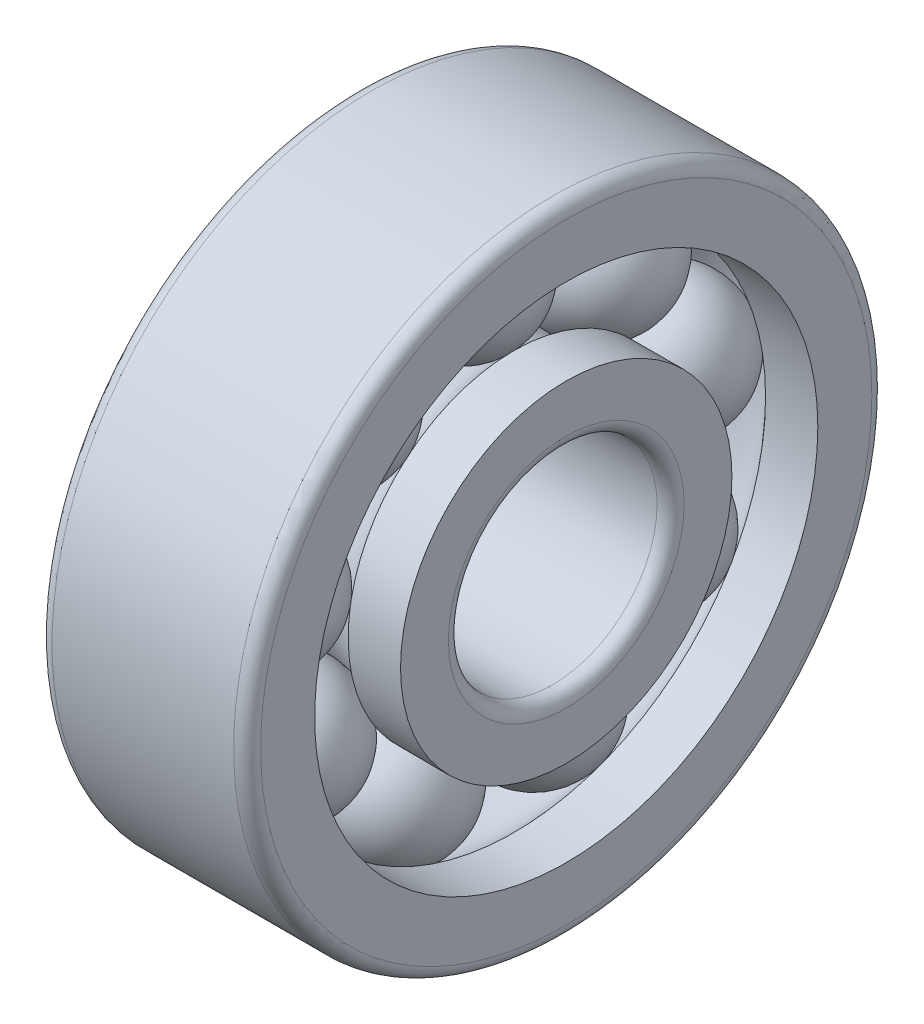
ISO-10303-21;
HEADER;
FILE_DESCRIPTION(('STEP AP214'),'2;1');
FILE_NAME('part.step','',(''),(''),'','','');
FILE_SCHEMA(('AUTOMOTIVE_DESIGN { 1 0 10303 214 1 1 1 1 }'));
ENDSEC;
DATA;
#1=APPLICATION_CONTEXT('core data for automotive mechanical design processes');
#2=APPLICATION_PROTOCOL_DEFINITION('international standard','automotive_design',2000,#1);
#3=PRODUCT_CONTEXT('',#1,'mechanical');
#4=PRODUCT('Part','Part','',(#3));
#5=PRODUCT_RELATED_PRODUCT_CATEGORY('part','',(#4));
#6=PRODUCT_DEFINITION_FORMATION('','',#4);
#7=PRODUCT_DEFINITION_CONTEXT('part definition',#1,'design');
#8=PRODUCT_DEFINITION('design','',#6,#7);
#9=PRODUCT_DEFINITION_SHAPE('','',#8);
#10=(LENGTH_UNIT() NAMED_UNIT(*) SI_UNIT(.MILLI.,.METRE.));
#11=(NAMED_UNIT(*) PLANE_ANGLE_UNIT() SI_UNIT($,.RADIAN.));
#12=(NAMED_UNIT(*) SI_UNIT($,.STERADIAN.) SOLID_ANGLE_UNIT());
#13=UNCERTAINTY_MEASURE_WITH_UNIT(LENGTH_MEASURE(1.E-05),#10,'distance_accuracy_value','');
#14=(GEOMETRIC_REPRESENTATION_CONTEXT(3) GLOBAL_UNCERTAINTY_ASSIGNED_CONTEXT((#13)) GLOBAL_UNIT_ASSIGNED_CONTEXT((#10,
#11,#12)) REPRESENTATION_CONTEXT('',''));
#15=CARTESIAN_POINT('',(0.,0.,0.));
#16=DIRECTION('',(0.,0.,1.));
#17=DIRECTION('',(1.,0.,0.));
#18=AXIS2_PLACEMENT_3D('',#15,#16,#17);
#19=CARTESIAN_POINT('',(0.,0.,0.));
#20=DIRECTION('',(1.,0.,0.));
#21=DIRECTION('',(0.,0.,-1.));
#22=AXIS2_PLACEMENT_3D('',#19,#20,#21);
#23=TOROIDAL_SURFACE('',#22,17.,5.5);
#24=CARTESIAN_POINT('',(4.24264068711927,0.,0.));
#25=DIRECTION('',(1.,0.,0.));
#26=DIRECTION('',(0.,0.,-1.));
#27=AXIS2_PLACEMENT_3D('',#24,#25,#26);
#28=CIRCLE('',#27,20.5);
#29=CARTESIAN_POINT('',(4.24264068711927,0.,-20.5));
#30=VERTEX_POINT('',#29);
#31=EDGE_CURVE('E11',#30,#30,#28,.T.);
#32=ORIENTED_EDGE('',*,*,#31,.T.);
#33=EDGE_LOOP('',(#32));
#34=FACE_BOUND('',#33,.T.);
#35=CARTESIAN_POINT('',(-4.24264068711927,0.,0.));
#36=DIRECTION('',(1.,0.,0.));
#37=DIRECTION('',(0.,0.,-1.));
#38=AXIS2_PLACEMENT_3D('',#35,#36,#37);
#39=CIRCLE('',#38,20.5);
#40=CARTESIAN_POINT('',(-4.24264068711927,0.,-20.5));
#41=VERTEX_POINT('',#40);
#42=EDGE_CURVE('E68',#41,#41,#39,.T.);
#43=ORIENTED_EDGE('',*,*,#42,.F.);
#44=EDGE_LOOP('',(#43));
#45=FACE_BOUND('',#44,.T.);
#46=ADVANCED_FACE('F40',(#34,#45),#23,.F.);
#47=CARTESIAN_POINT('',(-20.6375,0.,0.));
#48=DIRECTION('',(1.,0.,0.));
#49=DIRECTION('',(0.,0.,-1.));
#50=AXIS2_PLACEMENT_3D('',#47,#48,#49);
#51=CYLINDRICAL_SURFACE('',#50,20.5);
#52=CARTESIAN_POINT('',(8.50000000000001,0.,0.));
#53=DIRECTION('',(1.,0.,0.));
#54=DIRECTION('',(0.,0.,-1.));
#55=AXIS2_PLACEMENT_3D('',#52,#53,#54);
#56=CIRCLE('',#55,20.5);
#57=CARTESIAN_POINT('',(8.50000000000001,0.,-20.5));
#58=VERTEX_POINT('',#57);
#59=EDGE_CURVE('E46',#58,#58,#56,.T.);
#60=ORIENTED_EDGE('',*,*,#59,.T.);
#61=EDGE_LOOP('',(#60));
#62=FACE_BOUND('',#61,.T.);
#63=ORIENTED_EDGE('',*,*,#31,.F.);
#64=EDGE_LOOP('',(#63));
#65=FACE_BOUND('',#64,.T.);
#66=ADVANCED_FACE('F76',(#62,#65),#51,.F.);
#67=CARTESIAN_POINT('',(8.50000000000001,24.9,0.));
#68=DIRECTION('',(1.,0.,0.));
#69=DIRECTION('',(0.,0.,-1.));
#70=AXIS2_PLACEMENT_3D('',#67,#68,#69);
#71=PLANE('',#70);
#72=CARTESIAN_POINT('',(8.50000000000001,0.,0.));
#73=DIRECTION('',(1.,0.,0.));
#74=DIRECTION('',(0.,0.,-1.));
#75=AXIS2_PLACEMENT_3D('',#72,#73,#74);
#76=CIRCLE('',#75,24.9);
#77=CARTESIAN_POINT('',(8.50000000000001,0.,-24.9));
#78=VERTEX_POINT('',#77);
#79=EDGE_CURVE('E50',#78,#78,#76,.T.);
#80=ORIENTED_EDGE('',*,*,#79,.T.);
#81=EDGE_LOOP('',(#80));
#82=FACE_BOUND('',#81,.T.);
#83=ORIENTED_EDGE('',*,*,#59,.F.);
#84=EDGE_LOOP('',(#83));
#85=FACE_BOUND('',#84,.T.);
#86=ADVANCED_FACE('F80',(#82,#85),#71,.T.);
#87=CARTESIAN_POINT('',(7.40000000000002,0.,0.));
#88=DIRECTION('',(1.,0.,0.));
#89=DIRECTION('',(0.,0.,-1.));
#90=AXIS2_PLACEMENT_3D('',#87,#88,#89);
#91=TOROIDAL_SURFACE('',#90,24.9,1.1);
#92=CARTESIAN_POINT('',(7.40000000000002,0.,0.));
#93=DIRECTION('',(1.,0.,0.));
#94=DIRECTION('',(0.,0.,-1.));
#95=AXIS2_PLACEMENT_3D('',#92,#93,#94);
#96=CIRCLE('',#95,26.);
#97=CARTESIAN_POINT('',(7.40000000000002,0.,-26.));
#98=VERTEX_POINT('',#97);
#99=EDGE_CURVE('E54',#98,#98,#96,.T.);
#100=ORIENTED_EDGE('',*,*,#99,.T.);
#101=EDGE_LOOP('',(#100));
#102=FACE_BOUND('',#101,.T.);
#103=ORIENTED_EDGE('',*,*,#79,.F.);
#104=EDGE_LOOP('',(#103));
#105=FACE_BOUND('',#104,.T.);
#106=ADVANCED_FACE('F84',(#102,#105),#91,.T.);
#107=CARTESIAN_POINT('',(-20.6375,0.,0.));
#108=DIRECTION('',(1.,0.,0.));
#109=DIRECTION('',(0.,0.,-1.));
#110=AXIS2_PLACEMENT_3D('',#107,#108,#109);
#111=CYLINDRICAL_SURFACE('',#110,26.);
#112=CARTESIAN_POINT('',(-7.40000000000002,0.,0.));
#113=DIRECTION('',(1.,0.,0.));
#114=DIRECTION('',(0.,0.,-1.));
#115=AXIS2_PLACEMENT_3D('',#112,#113,#114);
#116=CIRCLE('',#115,26.);
#117=CARTESIAN_POINT('',(-7.40000000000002,0.,-26.));
#118=VERTEX_POINT('',#117);
#119=EDGE_CURVE('E59',#118,#118,#116,.T.);
#120=ORIENTED_EDGE('',*,*,#119,.T.);
#121=EDGE_LOOP('',(#120));
#122=FACE_BOUND('',#121,.T.);
#123=ORIENTED_EDGE('',*,*,#99,.F.);
#124=EDGE_LOOP('',(#123));
#125=FACE_BOUND('',#124,.T.);
#126=ADVANCED_FACE('F91',(#122,#125),#111,.T.);
#127=CARTESIAN_POINT('',(-7.40000000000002,0.,0.));
#128=DIRECTION('',(1.,0.,0.));
#129=DIRECTION('',(0.,0.,-1.));
#130=AXIS2_PLACEMENT_3D('',#127,#128,#129);
#131=TOROIDAL_SURFACE('',#130,24.9,1.1);
#132=CARTESIAN_POINT('',(-8.50000000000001,0.,0.));
#133=DIRECTION('',(1.,0.,0.));
#134=DIRECTION('',(0.,0.,-1.));
#135=AXIS2_PLACEMENT_3D('',#132,#133,#134);
#136=CIRCLE('',#135,24.9);
#137=CARTESIAN_POINT('',(-8.50000000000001,0.,-24.9));
#138=VERTEX_POINT('',#137);
#139=EDGE_CURVE('E62',#138,#138,#136,.T.);
#140=ORIENTED_EDGE('',*,*,#139,.T.);
#141=EDGE_LOOP('',(#140));
#142=FACE_BOUND('',#141,.T.);
#143=ORIENTED_EDGE('',*,*,#119,.F.);
#144=EDGE_LOOP('',(#143));
#145=FACE_BOUND('',#144,.T.);
#146=ADVANCED_FACE('F95',(#142,#145),#131,.T.);
#147=CARTESIAN_POINT('',(-8.50000000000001,20.5,0.));
#148=DIRECTION('',(-1.,0.,0.));
#149=DIRECTION('',(0.,0.,1.));
#150=AXIS2_PLACEMENT_3D('',#147,#148,#149);
#151=PLANE('',#150);
#152=CARTESIAN_POINT('',(-8.50000000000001,0.,0.));
#153=DIRECTION('',(1.,0.,0.));
#154=DIRECTION('',(0.,0.,-1.));
#155=AXIS2_PLACEMENT_3D('',#152,#153,#154);
#156=CIRCLE('',#155,20.5);
#157=CARTESIAN_POINT('',(-8.50000000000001,0.,-20.5));
#158=VERTEX_POINT('',#157);
#159=EDGE_CURVE('E65',#158,#158,#156,.T.);
#160=ORIENTED_EDGE('',*,*,#159,.T.);
#161=EDGE_LOOP('',(#160));
#162=FACE_BOUND('',#161,.T.);
#163=ORIENTED_EDGE('',*,*,#139,.F.);
#164=EDGE_LOOP('',(#163));
#165=FACE_BOUND('',#164,.T.);
#166=ADVANCED_FACE('F99',(#162,#165),#151,.T.);
#167=CARTESIAN_POINT('',(-20.6375,0.,0.));
#168=DIRECTION('',(1.,0.,0.));
#169=DIRECTION('',(0.,0.,-1.));
#170=AXIS2_PLACEMENT_3D('',#167,#168,#169);
#171=CYLINDRICAL_SURFACE('',#170,20.5);
#172=ORIENTED_EDGE('',*,*,#42,.T.);
#173=EDGE_LOOP('',(#172));
#174=FACE_BOUND('',#173,.T.);
#175=ORIENTED_EDGE('',*,*,#159,.F.);
#176=EDGE_LOOP('',(#175));
#177=FACE_BOUND('',#176,.T.);
#178=ADVANCED_FACE('F72',(#174,#177),#171,.F.);
#179=CLOSED_SHELL('',(#46,#66,#86,#106,#126,#146,#166,#178));
#180=MANIFOLD_SOLID_BREP('B2',#179);
#181=CARTESIAN_POINT('',(0.,0.,0.));
#182=DIRECTION('',(1.,0.,0.));
#183=DIRECTION('',(0.,0.,-1.));
#184=AXIS2_PLACEMENT_3D('',#181,#182,#183);
#185=TOROIDAL_SURFACE('',#184,17.01,5.5);
#186=CARTESIAN_POINT('',(4.23437126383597,0.,0.));
#187=DIRECTION('',(1.,0.,0.));
#188=DIRECTION('',(0.,0.,-1.));
#189=AXIS2_PLACEMENT_3D('',#186,#187,#188);
#190=CIRCLE('',#189,13.5);
#191=CARTESIAN_POINT('',(4.23437126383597,10.1883671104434,8.85704101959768));
#192=VERTEX_POINT('',#191);
#193=CARTESIAN_POINT('',(4.23437126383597,2.57623897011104,13.2519052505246));
#194=VERTEX_POINT('',#193);
#195=EDGE_CURVE('E301',#192,#194,#190,.T.);
#196=ORIENTED_EDGE('',*,*,#195,.F.);
#197=CARTESIAN_POINT('',(-4.23457126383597,10.1885559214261,8.85719160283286));
#198=CARTESIAN_POINT('',(-4.13594457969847,10.095422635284,8.78291134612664));
#199=CARTESIAN_POINT('',(-4.03227149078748,10.0056563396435,8.71111627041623));
#200=CARTESIAN_POINT('',(-3.81562555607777,9.83341009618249,8.57304357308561));
#201=CARTESIAN_POINT('',(-3.70265314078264,9.75092981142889,8.50676569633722));
#202=CARTESIAN_POINT('',(-3.4682724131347,9.59385290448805,8.38031071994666));
#203=CARTESIAN_POINT('',(-3.34686991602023,9.51925093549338,8.32012948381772));
#204=CARTESIAN_POINT('',(-3.09642703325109,9.37835526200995,8.20629298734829));
#205=CARTESIAN_POINT('',(-2.96738674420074,9.31206145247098,8.15263764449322));
#206=CARTESIAN_POINT('',(-2.70254359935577,9.18820164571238,8.05226294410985));
#207=CARTESIAN_POINT('',(-2.56673880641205,9.13063816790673,8.00554558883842));
#208=CARTESIAN_POINT('',(-2.28931478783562,9.02462371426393,7.91941768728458));
#209=CARTESIAN_POINT('',(-2.14769343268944,8.97617611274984,7.88000984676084));
#210=CARTESIAN_POINT('',(-1.85977147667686,8.8887664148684,7.8088526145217));
#211=CARTESIAN_POINT('',(-1.71347354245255,8.8497990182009,7.7770989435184));
#212=CARTESIAN_POINT('',(-1.41710822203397,8.7815611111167,7.72146063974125));
#213=CARTESIAN_POINT('',(-1.26703946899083,8.7522941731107,7.69757890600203));
#214=CARTESIAN_POINT('',(-0.964338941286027,8.70368578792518,7.65789941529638));
#215=CARTESIAN_POINT('',(-0.811708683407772,8.68433866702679,7.64209703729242));
#216=CARTESIAN_POINT('',(-0.504832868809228,8.65566841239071,7.61867542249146));
#217=CARTESIAN_POINT('',(-0.350586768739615,8.6463487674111,7.61105903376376));
#218=CARTESIAN_POINT('',(-0.0416442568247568,8.63780797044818,7.6040792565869));
#219=CARTESIAN_POINT('',(0.113052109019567,8.63858582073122,7.60471505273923));
#220=CARTESIAN_POINT('',(0.421810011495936,8.65023240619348,7.61423267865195));
#221=CARTESIAN_POINT('',(0.575871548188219,8.66110114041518,7.62311450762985));
#222=CARTESIAN_POINT('',(0.882226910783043,8.69285324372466,7.64905141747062));
#223=CARTESIAN_POINT('',(1.03452115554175,8.7137341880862,7.66610451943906));
#224=CARTESIAN_POINT('',(1.33624482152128,8.7653617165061,7.70824212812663));
#225=CARTESIAN_POINT('',(1.48567521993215,8.79610486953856,7.73332384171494));
#226=CARTESIAN_POINT('',(1.78077036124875,8.86728011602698,7.79134464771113));
#227=CARTESIAN_POINT('',(1.92643232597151,8.90771914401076,7.82428936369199));
#228=CARTESIAN_POINT('',(2.2127907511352,8.99798895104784,7.89775425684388));
#229=CARTESIAN_POINT('',(2.35348901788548,9.04781627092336,7.93827164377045));
#230=CARTESIAN_POINT('',(2.62915017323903,9.15660983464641,8.02662649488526));
#231=CARTESIAN_POINT('',(2.76410562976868,9.21558748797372,8.07447309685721));
#232=CARTESIAN_POINT('',(3.02708391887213,9.34222186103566,8.17705241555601));
#233=CARTESIAN_POINT('',(3.1551093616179,9.40987528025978,8.2317825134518));
#234=CARTESIAN_POINT('',(3.40319115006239,9.55332469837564,8.34762285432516));
#235=CARTESIAN_POINT('',(3.52325855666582,9.62910899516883,8.40872392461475));
#236=CARTESIAN_POINT('',(3.75472593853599,9.788373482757,8.53686151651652));
#237=CARTESIAN_POINT('',(3.86613080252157,9.87184927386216,8.60389464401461));
#238=CARTESIAN_POINT('',(4.01820562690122,9.99592571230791,8.70328446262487));
#239=CARTESIAN_POINT('',(4.06274577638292,10.0336089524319,8.73344008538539));
#240=CARTESIAN_POINT('',(4.15001215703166,10.1101787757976,8.79464605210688));
#241=CARTESIAN_POINT('',(4.19274070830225,10.1490637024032,8.82569516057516));
#242=CARTESIAN_POINT('',(4.23457126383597,10.188555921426,8.857191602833));
#243=B_SPLINE_CURVE_WITH_KNOTS('',3,(#197,#198,#199,#200,#201,#202,#203,#204,#205,#206,#207,
#208,#209,#210,#211,#212,#213,#214,#215,#216,#217,#218,#219,#220,#221,#222,#223,#224,#225,#226,
#227,#228,#229,#230,#231,#232,#233,#234,#235,#236,#237,#238,#239,#240,#241,#242),.UNSPECIFIED.,
.F.,.F.,(4,2,2,2,2,2,2,2,2,2,2,2,2,2,2,2,2,2,2,2,2,2,4),(0.,0.463827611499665,0.927633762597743,
1.39112308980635,1.85460655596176,2.31822352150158,2.78201176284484,3.24554010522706,
3.70923896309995,4.17267230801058,4.63626683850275,5.09981556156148,5.56336424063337,
6.0268007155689,6.49007613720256,6.95368388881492,7.41712115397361,7.88114098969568,
8.34498481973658,8.80816981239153,9.27109147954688,9.46808235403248,9.66481281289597),.UNSPECIFIED.);
#244=CARTESIAN_POINT('',(-4.23437126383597,10.1883671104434,8.85704101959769));
#245=VERTEX_POINT('',#244);
#246=EDGE_CURVE('E290',#245,#192,#243,.T.);
#247=ORIENTED_EDGE('',*,*,#246,.F.);
#248=CARTESIAN_POINT('',(-4.23437126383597,0.,0.));
#249=DIRECTION('',(1.,0.,0.));
#250=DIRECTION('',(0.,0.,-1.));
#251=AXIS2_PLACEMENT_3D('',#248,#249,#250);
#252=CIRCLE('',#251,13.5);
#253=CARTESIAN_POINT('',(-4.23437126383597,2.57623897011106,13.2519052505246));
#254=VERTEX_POINT('',#253);
#255=EDGE_CURVE('E189',#245,#254,#252,.T.);
#256=ORIENTED_EDGE('',*,*,#255,.T.);
#257=CARTESIAN_POINT('',(4.23457126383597,2.57627497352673,13.2521440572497));
#258=CARTESIAN_POINT('',(4.13594457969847,2.55851302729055,13.1343481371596));
#259=CARTESIAN_POINT('',(4.03227149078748,2.54121981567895,13.0207107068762));
#260=CARTESIAN_POINT('',(3.81562555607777,2.50776847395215,12.8025047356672));
#261=CARTESIAN_POINT('',(3.70265314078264,2.49161029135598,12.697935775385));
#262=CARTESIAN_POINT('',(3.4682724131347,2.46063552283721,12.498675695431));
#263=CARTESIAN_POINT('',(3.34686991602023,2.4458180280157,12.4039778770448));
#264=CARTESIAN_POINT('',(3.09642703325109,2.41768056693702,12.2250403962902));
#265=CARTESIAN_POINT('',(2.96738674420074,2.40436058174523,12.1408006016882));
#266=CARTESIAN_POINT('',(2.70254359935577,2.37936344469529,11.9833475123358));
#267=CARTESIAN_POINT('',(2.56673880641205,2.36768676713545,11.9101374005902));
#268=CARTESIAN_POINT('',(2.28931478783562,2.34610504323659,11.7752622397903));
#269=CARTESIAN_POINT('',(2.14769343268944,2.33620065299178,11.7136014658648));
#270=CARTESIAN_POINT('',(1.85977147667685,2.31828153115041,11.6023238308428));
#271=CARTESIAN_POINT('',(1.71347354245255,2.31026574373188,11.5527002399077));
#272=CARTESIAN_POINT('',(1.41710822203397,2.29620051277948,11.4657853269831));
#273=CARTESIAN_POINT('',(1.26703946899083,2.29015179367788,11.4284985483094));
#274=CARTESIAN_POINT('',(0.964338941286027,2.28009253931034,11.3665627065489));
#275=CARTESIAN_POINT('',(0.811708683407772,2.27608083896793,11.3419064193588));
#276=CARTESIAN_POINT('',(0.504832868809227,2.2701322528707,11.3053664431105));
#277=CARTESIAN_POINT('',(0.350586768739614,2.2681960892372,11.2934871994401));
#278=CARTESIAN_POINT('',(0.0416442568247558,2.26642182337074,11.2826007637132));
#279=CARTESIAN_POINT('',(-0.113052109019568,2.26658351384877,11.2835922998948));
#280=CARTESIAN_POINT('',(-0.421810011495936,2.26900272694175,11.2984373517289));
#281=CARTESIAN_POINT('',(-0.575871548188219,2.27126024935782,11.3122908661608));
#282=CARTESIAN_POINT('',(-0.882226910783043,2.27784622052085,11.3527574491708));
#283=CARTESIAN_POINT('',(-1.03452115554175,2.2821741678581,11.3793674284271));
#284=CARTESIAN_POINT('',(-1.33624482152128,2.29285264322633,11.4451469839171));
#285=CARTESIAN_POINT('',(-1.48567521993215,2.29920246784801,11.4843121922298));
#286=CARTESIAN_POINT('',(-1.78077036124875,2.31386233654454,11.5749621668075));
#287=CARTESIAN_POINT('',(-1.92643232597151,2.32217378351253,11.6264557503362));
#288=CARTESIAN_POINT('',(-2.2127907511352,2.34066134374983,11.741364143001));
#289=CARTESIAN_POINT('',(-2.35348901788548,2.35083677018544,11.804774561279));
#290=CARTESIAN_POINT('',(-2.62915017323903,2.37295753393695,11.9431699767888));
#291=CARTESIAN_POINT('',(-2.76410562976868,2.38490508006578,12.0181694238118));
#292=CARTESIAN_POINT('',(-3.02708391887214,2.41042418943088,12.1791276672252));
#293=CARTESIAN_POINT('',(-3.1551093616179,2.42399513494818,12.265082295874));
#294=CARTESIAN_POINT('',(-3.40319115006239,2.45259110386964,12.4472333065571));
#295=CARTESIAN_POINT('',(-3.52325855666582,2.46761403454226,12.5434149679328));
#296=CARTESIAN_POINT('',(-3.75472593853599,2.49895220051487,12.7454108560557));
#297=CARTESIAN_POINT('',(-3.86613080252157,2.51526669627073,12.8512195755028));
#298=CARTESIAN_POINT('',(-4.01820562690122,2.53930258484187,13.0083678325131));
#299=CARTESIAN_POINT('',(-4.06274577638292,2.54657650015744,13.0560802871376));
#300=CARTESIAN_POINT('',(-4.15001215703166,2.56129751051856,13.1529946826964));
#301=CARTESIAN_POINT('',(-4.19274070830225,2.56874436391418,13.2021945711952));
#302=CARTESIAN_POINT('',(-4.23457126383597,2.57627497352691,13.2521440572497));
#303=B_SPLINE_CURVE_WITH_KNOTS('',3,(#257,#258,#259,#260,#261,#262,#263,#264,#265,#266,#267,
#268,#269,#270,#271,#272,#273,#274,#275,#276,#277,#278,#279,#280,#281,#282,#283,#284,#285,#286,
#287,#288,#289,#290,#291,#292,#293,#294,#295,#296,#297,#298,#299,#300,#301,#302),.UNSPECIFIED.,
.F.,.F.,(4,2,2,2,2,2,2,2,2,2,2,2,2,2,2,2,2,2,2,2,2,2,4),(0.,0.463827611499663,0.927633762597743,
1.39112308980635,1.85460655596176,2.31822352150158,2.78201176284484,3.24554010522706,
3.70923896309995,4.17267230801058,4.63626683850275,5.09981556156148,5.56336424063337,
6.0268007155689,6.49007613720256,6.95368388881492,7.41712115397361,7.88114098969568,
8.34498481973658,8.80816981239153,9.27109147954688,9.46808235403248,9.66481281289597),.UNSPECIFIED.);
#304=EDGE_CURVE('E306',#194,#254,#303,.T.);
#305=ORIENTED_EDGE('',*,*,#304,.F.);
#306=EDGE_LOOP('',(#196,#247,#256,#305));
#307=FACE_BOUND('',#306,.T.);
#308=ADVANCED_FACE('F161',(#307),#185,.F.);
#309=CARTESIAN_POINT('',(-4.23437126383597,13.4979382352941,0.235930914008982));
#310=VERTEX_POINT('',#309);
#311=CARTESIAN_POINT('',(-4.23437126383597,10.4916740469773,8.49557388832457));
#312=VERTEX_POINT('',#311);
#313=EDGE_CURVE('E375',#310,#312,#252,.T.);
#314=ORIENTED_EDGE('',*,*,#313,.T.);
#315=CARTESIAN_POINT('',(4.23457126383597,10.4918551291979,8.49573368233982));
#316=CARTESIAN_POINT('',(4.13594457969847,10.4025309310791,8.41691393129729));
#317=CARTESIAN_POINT('',(4.03227149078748,10.3162388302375,8.34097847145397));
#318=CARTESIAN_POINT('',(3.81562555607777,10.1503535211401,8.19532510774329));
#319=CARTESIAN_POINT('',(3.70265314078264,10.0707600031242,8.12560691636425));
#320=CARTESIAN_POINT('',(3.4682724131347,9.91895004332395,7.99287503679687));
#321=CARTESIAN_POINT('',(3.34686991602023,9.846728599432,7.9298568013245));
#322=CARTESIAN_POINT('',(3.09642703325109,9.71015525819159,7.81086914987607));
#323=CARTESIAN_POINT('',(2.96738674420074,9.64580326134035,7.75489964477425));
#324=CARTESIAN_POINT('',(2.70254359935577,9.52544544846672,7.65035143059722));
#325=CARTESIAN_POINT('',(2.56673880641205,9.46944204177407,7.60177485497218));
#326=CARTESIAN_POINT('',(2.28931478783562,9.36621339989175,7.51232695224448));
#327=CARTESIAN_POINT('',(2.14769343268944,9.31899141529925,7.4714584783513));
#328=CARTESIAN_POINT('',(1.85977147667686,9.23373668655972,7.39773305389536));
#329=CARTESIAN_POINT('',(1.71347354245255,9.19569880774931,7.36487162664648));
#330=CARTESIAN_POINT('',(1.41710822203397,9.12905638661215,7.30733189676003));
#331=CARTESIAN_POINT('',(1.26703946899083,9.10045531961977,7.28265660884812));
#332=CARTESIAN_POINT('',(0.964338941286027,9.05293789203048,7.2416769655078));
#333=CARTESIAN_POINT('',(0.811708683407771,9.03401599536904,7.22536782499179));
#334=CARTESIAN_POINT('',(0.504832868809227,9.00597167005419,7.20120025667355));
#335=CARTESIAN_POINT('',(0.350586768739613,8.99685265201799,7.19334477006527));
#336=CARTESIAN_POINT('',(0.0416442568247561,8.98849581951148,7.18614575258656));
#337=CARTESIAN_POINT('',(-0.113052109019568,8.98925702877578,7.18680138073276));
#338=CARTESIAN_POINT('',(-0.421810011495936,9.00065246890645,7.19661830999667));
#339=CARTESIAN_POINT('',(-0.575871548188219,9.01128669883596,7.20577961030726));
#340=CARTESIAN_POINT('',(-0.882226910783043,9.04234326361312,7.23254543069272));
#341=CARTESIAN_POINT('',(-1.03452115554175,9.06276322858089,7.2501479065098));
#342=CARTESIAN_POINT('',(-1.33624482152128,9.11322569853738,7.29367397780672));
#343=CARTESIAN_POINT('',(-1.48567521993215,9.1432648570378,7.31959467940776));
#344=CARTESIAN_POINT('',(-1.78077036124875,9.21276364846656,7.37961340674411));
#345=CARTESIAN_POINT('',(-1.92643232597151,9.2522300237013,7.41371728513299));
#346=CARTESIAN_POINT('',(-2.2127907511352,9.34025400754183,7.4898586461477));
#347=CARTESIAN_POINT('',(-2.35348901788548,9.38880826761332,7.5318932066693));
#348=CARTESIAN_POINT('',(-2.62915017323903,9.49471261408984,7.62369129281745));
#349=CARTESIAN_POINT('',(-2.76410562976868,9.55207368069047,7.67346446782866));
#350=CARTESIAN_POINT('',(-3.02708391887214,9.67508441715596,7.78036226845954));
#351=CARTESIAN_POINT('',(-3.1551093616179,9.74073093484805,7.83748409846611));
#352=CARTESIAN_POINT('',(-3.40319115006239,9.87972113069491,7.95863873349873));
#353=CARTESIAN_POINT('',(-3.52325855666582,9.95305374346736,8.02266160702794));
#354=CARTESIAN_POINT('',(-3.75472593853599,10.1069006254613,8.1572556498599));
#355=CARTESIAN_POINT('',(-3.86613080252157,10.1874107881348,8.22782307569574));
#356=CARTESIAN_POINT('',(-4.01820562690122,10.3068362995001,8.33275565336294));
#357=CARTESIAN_POINT('',(-4.06274577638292,10.3430774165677,8.36462993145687));
#358=CARTESIAN_POINT('',(-4.15001215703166,10.4166497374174,8.42940818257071));
#359=CARTESIAN_POINT('',(-4.19274070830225,10.4539794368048,8.46231073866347));
#360=CARTESIAN_POINT('',(-4.23457126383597,10.491855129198,8.49573368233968));
#361=B_SPLINE_CURVE_WITH_KNOTS('',3,(#315,#316,#317,#318,#319,#320,#321,#322,#323,#324,#325,
#326,#327,#328,#329,#330,#331,#332,#333,#334,#335,#336,#337,#338,#339,#340,#341,#342,#343,#344,
#345,#346,#347,#348,#349,#350,#351,#352,#353,#354,#355,#356,#357,#358,#359,#360),.UNSPECIFIED.,
.F.,.F.,(4,2,2,2,2,2,2,2,2,2,2,2,2,2,2,2,2,2,2,2,2,2,4),(0.,0.463827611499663,0.927633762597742,
1.39112308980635,1.85460655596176,2.31822352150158,2.78201176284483,3.24554010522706,
3.70923896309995,4.17267230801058,4.63626683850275,5.09981556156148,5.56336424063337,
6.02680071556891,6.49007613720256,6.95368388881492,7.41712115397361,7.88114098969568,
8.34498481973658,8.80816981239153,9.27109147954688,9.46808235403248,9.66481281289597),.UNSPECIFIED.);
#362=CARTESIAN_POINT('',(4.23437126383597,10.4916740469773,8.49557388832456));
#363=VERTEX_POINT('',#362);
#364=EDGE_CURVE('E181',#363,#312,#361,.T.);
#365=ORIENTED_EDGE('',*,*,#364,.F.);
#366=CARTESIAN_POINT('',(4.23437126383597,13.4979382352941,0.235930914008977));
#367=VERTEX_POINT('',#366);
#368=EDGE_CURVE('E304',#367,#363,#190,.T.);
#369=ORIENTED_EDGE('',*,*,#368,.F.);
#370=CARTESIAN_POINT('',(-4.23457126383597,13.498179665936,0.235924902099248));
#371=CARTESIAN_POINT('',(-4.13594457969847,13.3790890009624,0.238887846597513));
#372=CARTESIAN_POINT('',(-4.03227149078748,13.2641750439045,0.241590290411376));
#373=CARTESIAN_POINT('',(-3.81562555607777,13.0434753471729,0.246538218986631));
#374=CARTESIAN_POINT('',(-3.70265314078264,12.9376891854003,0.248783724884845));
#375=CARTESIAN_POINT('',(-3.4682724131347,12.7360776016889,0.252880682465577));
#376=CARTESIAN_POINT('',(-3.34686991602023,12.6402454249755,0.254732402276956));
#377=CARTESIAN_POINT('',(-3.09642703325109,12.4591403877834,0.258094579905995));
#378=CARTESIAN_POINT('',(-2.96738674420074,12.3738673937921,0.259605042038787));
#379=CARTESIAN_POINT('',(-2.70254359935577,12.2144656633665,0.262329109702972));
#380=CARTESIAN_POINT('',(-2.56673880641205,12.1403401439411,0.263542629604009));
#381=CARTESIAN_POINT('',(-2.28931478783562,12.0037664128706,0.265709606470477));
#382=CARTESIAN_POINT('',(-2.14769343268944,11.9413225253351,0.266662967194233));
#383=CARTESIAN_POINT('',(-1.85977147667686,11.8286238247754,0.268339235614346));
#384=CARTESIAN_POINT('',(-1.71347354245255,11.7783622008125,0.269062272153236));
#385=CARTESIAN_POINT('',(-1.41710822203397,11.6903253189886,0.270303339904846));
#386=CARTESIAN_POINT('',(-1.26703946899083,11.6525546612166,0.270821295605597));
#387=CARTESIAN_POINT('',(-0.964338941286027,11.589812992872,0.271669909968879));
#388=CARTESIAN_POINT('',(-0.811708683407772,11.5648346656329,0.272000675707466));
#389=CARTESIAN_POINT('',(-0.504832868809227,11.5278168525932,0.272487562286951));
#390=CARTESIAN_POINT('',(-0.350586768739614,11.51578187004,0.272643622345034));
#391=CARTESIAN_POINT('',(-0.041644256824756,11.5047527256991,0.272786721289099));
#392=CARTESIAN_POINT('',(0.113052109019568,11.505757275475,0.272773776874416));
#393=CARTESIAN_POINT('',(0.421810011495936,11.52079688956,0.272578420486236));
#394=CARTESIAN_POINT('',(0.575871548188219,11.5348319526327,0.272396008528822));
#395=CARTESIAN_POINT('',(0.882226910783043,11.5758273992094,0.271854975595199));
#396=CARTESIAN_POINT('',(1.03452115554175,11.6027846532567,0.271496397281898));
#397=CARTESIAN_POINT('',(1.33624482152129,11.6694191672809,0.270590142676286));
#398=CARTESIAN_POINT('',(1.48567521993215,11.7090920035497,0.270042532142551));
#399=CARTESIAN_POINT('',(1.78077036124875,11.8009104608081,0.268738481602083));
#400=CARTESIAN_POINT('',(1.92643232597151,11.8530650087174,0.267981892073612));
#401=CARTESIAN_POINT('',(2.2127907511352,11.9694380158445,0.266234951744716));
#402=CARTESIAN_POINT('',(2.35348901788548,12.0336520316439,0.265244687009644));
#403=CARTESIAN_POINT('',(2.62915017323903,12.1737861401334,0.262997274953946));
#404=CARTESIAN_POINT('',(2.76410562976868,12.2497208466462,0.261739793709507));
#405=CARTESIAN_POINT('',(3.02708391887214,12.4126651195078,0.258921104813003));
#406=CARTESIAN_POINT('',(3.1551093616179,12.4996704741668,0.257360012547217));
#407=CARTESIAN_POINT('',(3.40319115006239,12.6840198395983,0.253891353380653));
#408=CARTESIAN_POINT('',(3.52325855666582,12.7813489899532,0.251984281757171));
#409=CARTESIAN_POINT('',(3.75472593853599,12.9857179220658,0.247770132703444));
#410=CARTESIAN_POINT('',(3.86613080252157,13.0927521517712,0.245463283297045));
#411=CARTESIAN_POINT('',(4.01820562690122,13.2516867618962,0.241845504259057));
#412=CARTESIAN_POINT('',(4.06274577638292,13.2999374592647,0.240723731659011));
#413=CARTESIAN_POINT('',(4.15001215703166,13.3979357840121,0.238392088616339));
#414=CARTESIAN_POINT('',(4.19274070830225,13.4476813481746,0.237182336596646));
#415=CARTESIAN_POINT('',(4.23457126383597,13.498179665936,0.23592490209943));
#416=B_SPLINE_CURVE_WITH_KNOTS('',3,(#370,#371,#372,#373,#374,#375,#376,#377,#378,#379,#380,
#381,#382,#383,#384,#385,#386,#387,#388,#389,#390,#391,#392,#393,#394,#395,#396,#397,#398,#399,
#400,#401,#402,#403,#404,#405,#406,#407,#408,#409,#410,#411,#412,#413,#414,#415),.UNSPECIFIED.,
.F.,.F.,(4,2,2,2,2,2,2,2,2,2,2,2,2,2,2,2,2,2,2,2,2,2,4),(0.,0.463827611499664,0.927633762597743,
1.39112308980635,1.85460655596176,2.31822352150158,2.78201176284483,3.24554010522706,
3.70923896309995,4.17267230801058,4.63626683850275,5.09981556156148,5.56336424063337,
6.02680071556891,6.49007613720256,6.95368388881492,7.41712115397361,7.88114098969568,
8.34498481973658,8.80816981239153,9.27109147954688,9.46808235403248,9.66481281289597),.UNSPECIFIED.);
#417=EDGE_CURVE('E322',#310,#367,#416,.T.);
#418=ORIENTED_EDGE('',*,*,#417,.F.);
#419=EDGE_LOOP('',(#314,#365,#369,#418));
#420=FACE_BOUND('',#419,.T.);
#421=ADVANCED_FACE('F357',(#420),#185,.F.);
#422=CARTESIAN_POINT('',(-20.6375,0.,0.));
#423=DIRECTION('',(1.,0.,0.));
#424=DIRECTION('',(0.,0.,-1.));
#425=AXIS2_PLACEMENT_3D('',#422,#423,#424);
#426=CYLINDRICAL_SURFACE('',#425,13.5);
#427=CARTESIAN_POINT('',(8.50000000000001,0.,0.));
#428=DIRECTION('',(1.,0.,0.));
#429=DIRECTION('',(0.,0.,-1.));
#430=AXIS2_PLACEMENT_3D('',#427,#428,#429);
#431=CIRCLE('',#430,13.5);
#432=CARTESIAN_POINT('',(8.50000000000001,0.,-13.5));
#433=VERTEX_POINT('',#432);
#434=EDGE_CURVE('E314',#433,#433,#431,.T.);
#435=ORIENTED_EDGE('',*,*,#434,.F.);
#436=EDGE_LOOP('',(#435));
#437=FACE_BOUND('',#436,.T.);
#438=ORIENTED_EDGE('',*,*,#368,.T.);
#439=CARTESIAN_POINT('',(4.23417126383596,10.1865079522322,8.85917917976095));
#440=CARTESIAN_POINT('',(4.23981754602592,10.2387444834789,8.79911612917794));
#441=CARTESIAN_POINT('',(4.2426406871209,10.2904418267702,8.73860064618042));
#442=CARTESIAN_POINT('',(4.2426406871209,10.392758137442,8.61666481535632));
#443=CARTESIAN_POINT('',(4.23981754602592,10.4433771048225,8.55524446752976));
#444=CARTESIAN_POINT('',(4.23417126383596,10.4934568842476,8.49337168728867));
#445=B_SPLINE_CURVE_WITH_KNOTS('',3,(#439,#440,#441,#442,#443,#444),.UNSPECIFIED.,.F.,.F.,(4,2,
4),(0.,0.238923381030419,0.477846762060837),.UNSPECIFIED.);
#446=EDGE_CURVE('E293',#192,#363,#445,.T.);
#447=ORIENTED_EDGE('',*,*,#446,.F.);
#448=ORIENTED_EDGE('',*,*,#195,.T.);
#449=CARTESIAN_POINT('',(4.23417126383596,2.10874720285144,13.3342860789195));
#450=CARTESIAN_POINT('',(4.23981754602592,2.18737049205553,13.321852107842));
#451=CARTESIAN_POINT('',(4.2426406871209,2.26587155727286,13.3087249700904));
#452=CARTESIAN_POINT('',(4.2426406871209,2.42262923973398,13.2810843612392));
#453=CARTESIAN_POINT('',(4.23981754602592,2.50088585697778,13.2665708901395));
#454=CARTESIAN_POINT('',(4.23417126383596,2.57902025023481,13.2513642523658));
#455=B_SPLINE_CURVE_WITH_KNOTS('',3,(#449,#450,#451,#452,#453,#454),.UNSPECIFIED.,.F.,.F.,(4,2,
4),(0.,0.238923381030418,0.477846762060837),.UNSPECIFIED.);
#456=CARTESIAN_POINT('',(4.23437126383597,2.11154578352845,13.3338431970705));
#457=VERTEX_POINT('',#456);
#458=EDGE_CURVE('E418',#457,#194,#455,.T.);
#459=ORIENTED_EDGE('',*,*,#458,.F.);
#460=CARTESIAN_POINT('',(4.23437126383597,-6.54464695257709,11.8075228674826));
#461=VERTEX_POINT('',#460);
#462=EDGE_CURVE('E307',#457,#461,#190,.T.);
#463=ORIENTED_EDGE('',*,*,#462,.T.);
#464=CARTESIAN_POINT('',(4.23417126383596,-6.95571979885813,11.5701323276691));
#465=CARTESIAN_POINT('',(4.23981754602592,-6.88749846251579,11.6111454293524));
#466=CARTESIAN_POINT('',(4.2426406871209,-6.81892519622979,11.6515489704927));
#467=CARTESIAN_POINT('',(4.2426406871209,-6.68107480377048,11.731136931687));
#468=CARTESIAN_POINT('',(4.23981754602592,-6.61179767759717,11.770321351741));
#469=CARTESIAN_POINT('',(4.23417126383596,-6.5421686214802,11.8088962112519));
#470=B_SPLINE_CURVE_WITH_KNOTS('',3,(#464,#465,#466,#467,#468,#469),.UNSPECIFIED.,.F.,.F.,(4,2,
4),(0.,0.238923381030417,0.477846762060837),.UNSPECIFIED.);
#471=CARTESIAN_POINT('',(4.23437126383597,-6.95329128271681,11.5715919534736));
#472=VERTEX_POINT('',#471);
#473=EDGE_CURVE('E451',#472,#461,#470,.T.);
#474=ORIENTED_EDGE('',*,*,#473,.F.);
#475=CARTESIAN_POINT('',(4.23437126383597,-12.6032198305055,4.83826930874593));
#476=VERTEX_POINT('',#475);
#477=EDGE_CURVE('E311',#472,#476,#190,.T.);
#478=ORIENTED_EDGE('',*,*,#477,.T.);
#479=CARTESIAN_POINT('',(4.23417126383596,-12.7655282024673,4.39218507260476));
#480=CARTESIAN_POINT('',(4.23981754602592,-12.739630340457,4.4674547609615));
#481=CARTESIAN_POINT('',(4.2426406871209,-12.7130710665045,4.5424837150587));
#482=CARTESIAN_POINT('',(4.2426406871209,-12.6586296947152,4.69206015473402));
#483=CARTESIAN_POINT('',(4.23981754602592,-12.6307475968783,4.76660764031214));
#484=CARTESIAN_POINT('',(4.23417126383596,-12.6022040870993,4.84091439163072));
#485=B_SPLINE_CURVE_WITH_KNOTS('',3,(#479,#480,#481,#482,#483,#484),.UNSPECIFIED.,.F.,.F.,(4,2,
4),(0.,0.238923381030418,0.477846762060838),.UNSPECIFIED.);
#486=CARTESIAN_POINT('',(4.23437126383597,-12.7646060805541,4.3948642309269));
#487=VERTEX_POINT('',#486);
#488=EDGE_CURVE('E486',#487,#476,#485,.T.);
#489=ORIENTED_EDGE('',*,*,#488,.F.);
#490=CARTESIAN_POINT('',(4.23437126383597,-12.7646060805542,-4.39486423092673));
#491=VERTEX_POINT('',#490);
#492=EDGE_CURVE('E668',#487,#491,#190,.T.);
#493=ORIENTED_EDGE('',*,*,#492,.T.);
#494=CARTESIAN_POINT('',(4.23417126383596,-12.6022040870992,-4.84091439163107));
#495=CARTESIAN_POINT('',(4.23981754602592,-12.6307475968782,-4.76660764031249));
#496=CARTESIAN_POINT('',(4.2426406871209,-12.658629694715,-4.69206015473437));
#497=CARTESIAN_POINT('',(4.2426406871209,-12.7130710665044,-4.54248371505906));
#498=CARTESIAN_POINT('',(4.23981754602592,-12.7396303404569,-4.46745476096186));
#499=CARTESIAN_POINT('',(4.23417126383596,-12.7655282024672,-4.39218507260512));
#500=B_SPLINE_CURVE_WITH_KNOTS('',3,(#494,#495,#496,#497,#498,#499),.UNSPECIFIED.,.F.,.F.,(4,2,
4),(0.,0.238923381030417,0.477846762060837),.UNSPECIFIED.);
#501=CARTESIAN_POINT('',(4.23437126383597,-12.6032198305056,-4.83826930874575));
#502=VERTEX_POINT('',#501);
#503=EDGE_CURVE('E521',#502,#491,#500,.T.);
#504=ORIENTED_EDGE('',*,*,#503,.F.);
#505=CARTESIAN_POINT('',(4.23437126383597,-6.95329128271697,-11.5715919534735));
#506=VERTEX_POINT('',#505);
#507=EDGE_CURVE('E664',#502,#506,#190,.T.);
#508=ORIENTED_EDGE('',*,*,#507,.T.);
#509=CARTESIAN_POINT('',(4.23417126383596,-6.54216862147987,-11.8088962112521));
#510=CARTESIAN_POINT('',(4.23981754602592,-6.61179767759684,-11.7703213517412));
#511=CARTESIAN_POINT('',(4.2426406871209,-6.68107480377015,-11.7311369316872));
#512=CARTESIAN_POINT('',(4.2426406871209,-6.81892519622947,-11.6515489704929));
#513=CARTESIAN_POINT('',(4.23981754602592,-6.88749846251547,-11.6111454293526));
#514=CARTESIAN_POINT('',(4.23417126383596,-6.95571979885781,-11.5701323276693));
#515=B_SPLINE_CURVE_WITH_KNOTS('',3,(#509,#510,#511,#512,#513,#514),.UNSPECIFIED.,.F.,.F.,(4,2,
4),(0.,0.238923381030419,0.477846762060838),.UNSPECIFIED.);
#516=CARTESIAN_POINT('',(4.23437126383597,-6.54464695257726,-11.8075228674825));
#517=VERTEX_POINT('',#516);
#518=EDGE_CURVE('E556',#517,#506,#515,.T.);
#519=ORIENTED_EDGE('',*,*,#518,.F.);
#520=CARTESIAN_POINT('',(4.23437126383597,2.11154578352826,-13.3338431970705));
#521=VERTEX_POINT('',#520);
#522=EDGE_CURVE('E660',#517,#521,#190,.T.);
#523=ORIENTED_EDGE('',*,*,#522,.T.);
#524=CARTESIAN_POINT('',(4.23417126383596,2.57902025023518,-13.2513642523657));
#525=CARTESIAN_POINT('',(4.23981754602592,2.50088585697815,-13.2665708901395));
#526=CARTESIAN_POINT('',(4.2426406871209,2.42262923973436,-13.2810843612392));
#527=CARTESIAN_POINT('',(4.2426406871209,2.26587155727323,-13.3087249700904));
#528=CARTESIAN_POINT('',(4.23981754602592,2.18737049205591,-13.3218521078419));
#529=CARTESIAN_POINT('',(4.23417126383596,2.10874720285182,-13.3342860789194));
#530=B_SPLINE_CURVE_WITH_KNOTS('',3,(#524,#525,#526,#527,#528,#529),.UNSPECIFIED.,.F.,.F.,(4,2,
4),(0.,0.238923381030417,0.477846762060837),.UNSPECIFIED.);
#531=CARTESIAN_POINT('',(4.23437126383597,2.57623897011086,-13.2519052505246));
#532=VERTEX_POINT('',#531);
#533=EDGE_CURVE('E591',#532,#521,#530,.T.);
#534=ORIENTED_EDGE('',*,*,#533,.F.);
#535=CARTESIAN_POINT('',(4.23437126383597,10.1883671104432,-8.85704101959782));
#536=VERTEX_POINT('',#535);
#537=EDGE_CURVE('E657',#532,#536,#190,.T.);
#538=ORIENTED_EDGE('',*,*,#537,.T.);
#539=CARTESIAN_POINT('',(4.23417126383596,10.4934568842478,-8.49337168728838));
#540=CARTESIAN_POINT('',(4.23981754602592,10.4433771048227,-8.55524446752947));
#541=CARTESIAN_POINT('',(4.2426406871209,10.3927581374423,-8.61666481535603));
#542=CARTESIAN_POINT('',(4.2426406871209,10.2904418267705,-8.73860064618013));
#543=CARTESIAN_POINT('',(4.23981754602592,10.2387444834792,-8.79911612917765));
#544=CARTESIAN_POINT('',(4.23417126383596,10.1865079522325,-8.85917917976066));
#545=B_SPLINE_CURVE_WITH_KNOTS('',3,(#539,#540,#541,#542,#543,#544),.UNSPECIFIED.,.F.,.F.,(4,2,
4),(0.,0.238923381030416,0.477846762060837),.UNSPECIFIED.);
#546=CARTESIAN_POINT('',(4.23437126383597,10.4916740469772,-8.49557388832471));
#547=VERTEX_POINT('',#546);
#548=EDGE_CURVE('E624',#547,#536,#545,.T.);
#549=ORIENTED_EDGE('',*,*,#548,.F.);
#550=CARTESIAN_POINT('',(4.23437126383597,13.4979382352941,-0.235930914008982));
#551=VERTEX_POINT('',#550);
#552=EDGE_CURVE('E310',#547,#551,#190,.T.);
#553=ORIENTED_EDGE('',*,*,#552,.T.);
#554=CARTESIAN_POINT('',(4.23417126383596,13.4978884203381,0.238763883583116));
#555=CARTESIAN_POINT('',(4.23981754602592,13.4992961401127,0.159175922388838));
#556=CARTESIAN_POINT('',(4.2426406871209,13.5,0.0795879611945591));
#557=CARTESIAN_POINT('',(4.2426406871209,13.5,-0.0795879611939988));
#558=CARTESIAN_POINT('',(4.23981754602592,13.4992961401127,-0.159175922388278));
#559=CARTESIAN_POINT('',(4.23417126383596,13.4978884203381,-0.238763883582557));
#560=B_SPLINE_CURVE_WITH_KNOTS('',3,(#554,#555,#556,#557,#558,#559),.UNSPECIFIED.,.F.,.F.,(4,2,
4),(0.,0.238923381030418,0.477846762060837),.UNSPECIFIED.);
#561=EDGE_CURVE('E38',#367,#551,#560,.T.);
#562=ORIENTED_EDGE('',*,*,#561,.F.);
#563=EDGE_LOOP('',(#438,#447,#448,#459,#463,#474,#478,#489,#493,#504,#508,#519,#523,#534,#538,
#549,#553,#562));
#564=FACE_BOUND('',#563,.T.);
#565=ADVANCED_FACE('F299',(#437,#564),#426,.T.);
#566=CARTESIAN_POINT('',(-20.6375,0.,0.));
#567=DIRECTION('',(1.,0.,0.));
#568=DIRECTION('',(0.,0.,-1.));
#569=AXIS2_PLACEMENT_3D('',#566,#567,#568);
#570=CYLINDRICAL_SURFACE('',#569,13.5);
#571=CARTESIAN_POINT('',(-8.50000000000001,0.,0.));
#572=DIRECTION('',(1.,0.,0.));
#573=DIRECTION('',(0.,0.,-1.));
#574=AXIS2_PLACEMENT_3D('',#571,#572,#573);
#575=CIRCLE('',#574,13.5);
#576=CARTESIAN_POINT('',(-8.50000000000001,0.,-13.5));
#577=VERTEX_POINT('',#576);
#578=EDGE_CURVE('E641',#577,#577,#575,.T.);
#579=ORIENTED_EDGE('',*,*,#578,.T.);
#580=EDGE_LOOP('',(#579));
#581=FACE_BOUND('',#580,.T.);
#582=ORIENTED_EDGE('',*,*,#255,.F.);
#583=CARTESIAN_POINT('',(-4.23417126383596,10.4934568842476,8.49337168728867));
#584=CARTESIAN_POINT('',(-4.23981754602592,10.4433771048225,8.55524446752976));
#585=CARTESIAN_POINT('',(-4.2426406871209,10.392758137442,8.61666481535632));
#586=CARTESIAN_POINT('',(-4.2426406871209,10.2904418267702,8.73860064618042));
#587=CARTESIAN_POINT('',(-4.23981754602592,10.2387444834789,8.79911612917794));
#588=CARTESIAN_POINT('',(-4.23417126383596,10.1865079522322,8.85917917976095));
#589=B_SPLINE_CURVE_WITH_KNOTS('',3,(#583,#584,#585,#586,#587,#588),.UNSPECIFIED.,.F.,.F.,(4,2,
4),(0.,0.238923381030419,0.477846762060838),.UNSPECIFIED.);
#590=EDGE_CURVE('E294',#312,#245,#589,.T.);
#591=ORIENTED_EDGE('',*,*,#590,.F.);
#592=ORIENTED_EDGE('',*,*,#313,.F.);
#593=CARTESIAN_POINT('',(-4.23417126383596,13.4978884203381,-0.238763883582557));
#594=CARTESIAN_POINT('',(-4.23981754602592,13.4992961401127,-0.159175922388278));
#595=CARTESIAN_POINT('',(-4.2426406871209,13.5,-0.079587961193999));
#596=CARTESIAN_POINT('',(-4.2426406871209,13.5,0.0795879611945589));
#597=CARTESIAN_POINT('',(-4.23981754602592,13.4992961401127,0.159175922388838));
#598=CARTESIAN_POINT('',(-4.23417126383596,13.4978884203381,0.238763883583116));
#599=B_SPLINE_CURVE_WITH_KNOTS('',3,(#593,#594,#595,#596,#597,#598),.UNSPECIFIED.,.F.,.F.,(4,2,
4),(0.,0.238923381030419,0.477846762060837),.UNSPECIFIED.);
#600=CARTESIAN_POINT('',(-4.23437126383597,13.4979382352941,-0.235930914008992));
#601=VERTEX_POINT('',#600);
#602=EDGE_CURVE('E309',#601,#310,#599,.T.);
#603=ORIENTED_EDGE('',*,*,#602,.F.);
#604=CARTESIAN_POINT('',(-4.23437126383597,10.4916740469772,-8.4955738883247));
#605=VERTEX_POINT('',#604);
#606=EDGE_CURVE('E639',#605,#601,#252,.T.);
#607=ORIENTED_EDGE('',*,*,#606,.F.);
#608=CARTESIAN_POINT('',(-4.23417126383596,10.1865079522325,-8.85917917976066));
#609=CARTESIAN_POINT('',(-4.23981754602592,10.2387444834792,-8.79911612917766));
#610=CARTESIAN_POINT('',(-4.2426406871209,10.2904418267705,-8.73860064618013));
#611=CARTESIAN_POINT('',(-4.2426406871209,10.3927581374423,-8.61666481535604));
#612=CARTESIAN_POINT('',(-4.23981754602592,10.4433771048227,-8.55524446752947));
#613=CARTESIAN_POINT('',(-4.23417126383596,10.4934568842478,-8.49337168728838));
#614=B_SPLINE_CURVE_WITH_KNOTS('',3,(#608,#609,#610,#611,#612,#613),.UNSPECIFIED.,.F.,.F.,(4,2,
4),(0.,0.238923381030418,0.477846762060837),.UNSPECIFIED.);
#615=CARTESIAN_POINT('',(-4.23437126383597,10.1883671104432,-8.85704101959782));
#616=VERTEX_POINT('',#615);
#617=EDGE_CURVE('E634',#616,#605,#614,.T.);
#618=ORIENTED_EDGE('',*,*,#617,.F.);
#619=CARTESIAN_POINT('',(-4.23437126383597,2.57623897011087,-13.2519052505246));
#620=VERTEX_POINT('',#619);
#621=EDGE_CURVE('E700',#620,#616,#252,.T.);
#622=ORIENTED_EDGE('',*,*,#621,.F.);
#623=CARTESIAN_POINT('',(-4.23417126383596,2.10874720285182,-13.3342860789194));
#624=CARTESIAN_POINT('',(-4.23981754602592,2.18737049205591,-13.3218521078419));
#625=CARTESIAN_POINT('',(-4.2426406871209,2.26587155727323,-13.3087249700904));
#626=CARTESIAN_POINT('',(-4.2426406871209,2.42262923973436,-13.2810843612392));
#627=CARTESIAN_POINT('',(-4.23981754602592,2.50088585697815,-13.2665708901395));
#628=CARTESIAN_POINT('',(-4.23417126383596,2.57902025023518,-13.2513642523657));
#629=B_SPLINE_CURVE_WITH_KNOTS('',3,(#623,#624,#625,#626,#627,#628),.UNSPECIFIED.,.F.,.F.,(4,2,
4),(0.,0.238923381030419,0.477846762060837),.UNSPECIFIED.);
#630=CARTESIAN_POINT('',(-4.23437126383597,2.11154578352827,-13.3338431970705));
#631=VERTEX_POINT('',#630);
#632=EDGE_CURVE('E601',#631,#620,#629,.T.);
#633=ORIENTED_EDGE('',*,*,#632,.F.);
#634=CARTESIAN_POINT('',(-4.23437126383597,-6.54464695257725,-11.8075228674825));
#635=VERTEX_POINT('',#634);
#636=EDGE_CURVE('E695',#635,#631,#252,.T.);
#637=ORIENTED_EDGE('',*,*,#636,.F.);
#638=CARTESIAN_POINT('',(-4.23417126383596,-6.95571979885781,-11.5701323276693));
#639=CARTESIAN_POINT('',(-4.23981754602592,-6.88749846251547,-11.6111454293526));
#640=CARTESIAN_POINT('',(-4.2426406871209,-6.81892519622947,-11.6515489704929));
#641=CARTESIAN_POINT('',(-4.2426406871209,-6.68107480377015,-11.7311369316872));
#642=CARTESIAN_POINT('',(-4.23981754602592,-6.61179767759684,-11.7703213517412));
#643=CARTESIAN_POINT('',(-4.23417126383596,-6.54216862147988,-11.8088962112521));
#644=B_SPLINE_CURVE_WITH_KNOTS('',3,(#638,#639,#640,#641,#642,#643),.UNSPECIFIED.,.F.,.F.,(4,2,
4),(0.,0.23892338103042,0.477846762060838),.UNSPECIFIED.);
#645=CARTESIAN_POINT('',(-4.23437126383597,-6.95329128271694,-11.5715919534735));
#646=VERTEX_POINT('',#645);
#647=EDGE_CURVE('E566',#646,#635,#644,.T.);
#648=ORIENTED_EDGE('',*,*,#647,.F.);
#649=CARTESIAN_POINT('',(-4.23437126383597,-12.6032198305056,-4.83826930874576));
#650=VERTEX_POINT('',#649);
#651=EDGE_CURVE('E691',#650,#646,#252,.T.);
#652=ORIENTED_EDGE('',*,*,#651,.F.);
#653=CARTESIAN_POINT('',(-4.23417126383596,-12.7655282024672,-4.39218507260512));
#654=CARTESIAN_POINT('',(-4.23981754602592,-12.7396303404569,-4.46745476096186));
#655=CARTESIAN_POINT('',(-4.2426406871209,-12.7130710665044,-4.54248371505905));
#656=CARTESIAN_POINT('',(-4.2426406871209,-12.658629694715,-4.69206015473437));
#657=CARTESIAN_POINT('',(-4.23981754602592,-12.6307475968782,-4.76660764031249));
#658=CARTESIAN_POINT('',(-4.23417126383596,-12.6022040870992,-4.84091439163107));
#659=B_SPLINE_CURVE_WITH_KNOTS('',3,(#653,#654,#655,#656,#657,#658),.UNSPECIFIED.,.F.,.F.,(4,2,
4),(0.,0.23892338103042,0.477846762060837),.UNSPECIFIED.);
#660=CARTESIAN_POINT('',(-4.23437126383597,-12.7646060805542,-4.39486423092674));
#661=VERTEX_POINT('',#660);
#662=EDGE_CURVE('E531',#661,#650,#659,.T.);
#663=ORIENTED_EDGE('',*,*,#662,.F.);
#664=CARTESIAN_POINT('',(-4.23437126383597,-12.7646060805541,4.3948642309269));
#665=VERTEX_POINT('',#664);
#666=EDGE_CURVE('E690',#665,#661,#252,.T.);
#667=ORIENTED_EDGE('',*,*,#666,.F.);
#668=CARTESIAN_POINT('',(-4.23417126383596,-12.6022040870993,4.84091439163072));
#669=CARTESIAN_POINT('',(-4.23981754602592,-12.6307475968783,4.76660764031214));
#670=CARTESIAN_POINT('',(-4.2426406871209,-12.6586296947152,4.69206015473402));
#671=CARTESIAN_POINT('',(-4.2426406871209,-12.7130710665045,4.5424837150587));
#672=CARTESIAN_POINT('',(-4.23981754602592,-12.739630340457,4.4674547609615));
#673=CARTESIAN_POINT('',(-4.23417126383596,-12.7655282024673,4.39218507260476));
#674=B_SPLINE_CURVE_WITH_KNOTS('',3,(#668,#669,#670,#671,#672,#673),.UNSPECIFIED.,.F.,.F.,(4,2,
4),(0.,0.238923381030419,0.477846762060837),.UNSPECIFIED.);
#675=CARTESIAN_POINT('',(-4.23437126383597,-12.6032198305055,4.83826930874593));
#676=VERTEX_POINT('',#675);
#677=EDGE_CURVE('E496',#676,#665,#674,.T.);
#678=ORIENTED_EDGE('',*,*,#677,.F.);
#679=CARTESIAN_POINT('',(-4.23437126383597,-6.95329128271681,11.5715919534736));
#680=VERTEX_POINT('',#679);
#681=EDGE_CURVE('E686',#680,#676,#252,.T.);
#682=ORIENTED_EDGE('',*,*,#681,.F.);
#683=CARTESIAN_POINT('',(-4.23417126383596,-6.5421686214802,11.8088962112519));
#684=CARTESIAN_POINT('',(-4.23981754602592,-6.61179767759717,11.770321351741));
#685=CARTESIAN_POINT('',(-4.2426406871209,-6.68107480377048,11.731136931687));
#686=CARTESIAN_POINT('',(-4.2426406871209,-6.81892519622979,11.6515489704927));
#687=CARTESIAN_POINT('',(-4.23981754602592,-6.88749846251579,11.6111454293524));
#688=CARTESIAN_POINT('',(-4.23417126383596,-6.95571979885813,11.5701323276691));
#689=B_SPLINE_CURVE_WITH_KNOTS('',3,(#683,#684,#685,#686,#687,#688),.UNSPECIFIED.,.F.,.F.,(4,2,
4),(0.,0.23892338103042,0.477846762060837),.UNSPECIFIED.);
#690=CARTESIAN_POINT('',(-4.23437126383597,-6.54464695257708,11.8075228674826));
#691=VERTEX_POINT('',#690);
#692=EDGE_CURVE('E461',#691,#680,#689,.T.);
#693=ORIENTED_EDGE('',*,*,#692,.F.);
#694=CARTESIAN_POINT('',(-4.23437126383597,2.11154578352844,13.3338431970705));
#695=VERTEX_POINT('',#694);
#696=EDGE_CURVE('E689',#695,#691,#252,.T.);
#697=ORIENTED_EDGE('',*,*,#696,.F.);
#698=CARTESIAN_POINT('',(-4.23417126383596,2.57902025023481,13.2513642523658));
#699=CARTESIAN_POINT('',(-4.23981754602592,2.50088585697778,13.2665708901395));
#700=CARTESIAN_POINT('',(-4.2426406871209,2.42262923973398,13.2810843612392));
#701=CARTESIAN_POINT('',(-4.2426406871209,2.26587155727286,13.3087249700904));
#702=CARTESIAN_POINT('',(-4.23981754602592,2.18737049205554,13.321852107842));
#703=CARTESIAN_POINT('',(-4.23417126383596,2.10874720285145,13.3342860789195));
#704=B_SPLINE_CURVE_WITH_KNOTS('',3,(#698,#699,#700,#701,#702,#703),.UNSPECIFIED.,.F.,.F.,(4,2,
4),(0.,0.238923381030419,0.477846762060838),.UNSPECIFIED.);
#705=EDGE_CURVE('E426',#254,#695,#704,.T.);
#706=ORIENTED_EDGE('',*,*,#705,.F.);
#707=EDGE_LOOP('',(#582,#591,#592,#603,#607,#618,#622,#633,#637,#648,#652,#663,#667,#678,#682,
#693,#697,#706));
#708=FACE_BOUND('',#707,.T.);
#709=ADVANCED_FACE('F326',(#581,#708),#570,.T.);
#710=ORIENTED_EDGE('',*,*,#462,.F.);
#711=CARTESIAN_POINT('',(-4.23457126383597,2.11159362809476,13.3340799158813));
#712=CARTESIAN_POINT('',(-4.13594457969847,2.08799582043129,13.2173130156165));
#713=CARTESIAN_POINT('',(-4.03227149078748,2.06537983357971,13.1046141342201));
#714=CARTESIAN_POINT('',(-3.81562555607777,2.02218297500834,12.8881265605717));
#715=CARTESIAN_POINT('',(-3.70265314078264,2.00160200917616,12.7843374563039));
#716=CARTESIAN_POINT('',(-3.4682724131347,1.96255780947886,12.5865002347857));
#717=CARTESIAN_POINT('',(-3.34686991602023,1.94409313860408,12.4924455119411));
#718=CARTESIAN_POINT('',(-3.09642703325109,1.9093334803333,12.314675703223));
#719=CARTESIAN_POINT('',(-2.96738674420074,1.89303846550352,12.2309604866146));
#720=CARTESIAN_POINT('',(-2.70254359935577,1.86267596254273,12.0744534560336));
#721=CARTESIAN_POINT('',(-2.56673880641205,1.8486091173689,12.0016647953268));
#722=CARTESIAN_POINT('',(-2.28931478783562,1.82275928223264,11.8675422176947));
#723=CARTESIAN_POINT('',(-2.14769343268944,1.8109771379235,11.8062125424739));
#724=CARTESIAN_POINT('',(-1.85977147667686,1.78975641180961,11.6955170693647));
#725=CARTESIAN_POINT('',(-1.71347354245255,1.78031652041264,11.6461445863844));
#726=CARTESIAN_POINT('',(-1.41710822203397,1.76380686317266,11.5596606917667));
#727=CARTESIAN_POINT('',(-1.26703946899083,1.75673797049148,11.52255379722));
#728=CARTESIAN_POINT('',(-0.964338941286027,1.74500727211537,11.460912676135));
#729=CARTESIAN_POINT('',(-0.811708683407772,1.74034409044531,11.4363712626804));
#730=CARTESIAN_POINT('',(-0.504832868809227,1.73343652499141,11.4000003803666));
#731=CARTESIAN_POINT('',(-0.350586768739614,1.73119298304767,11.3881753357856));
#732=CARTESIAN_POINT('',(-0.0416442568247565,1.72913686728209,11.3773385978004));
#733=CARTESIAN_POINT('',(0.113052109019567,1.72932405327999,11.378325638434));
#734=CARTESIAN_POINT('',(0.421810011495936,1.73212804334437,11.3931028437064));
#735=CARTESIAN_POINT('',(0.575871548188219,1.73474484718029,11.4068930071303));
#736=CARTESIAN_POINT('',(0.882226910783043,1.74239644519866,11.4471716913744));
#737=CARTESIAN_POINT('',(1.03452115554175,1.74743065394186,11.4736571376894));
#738=CARTESIAN_POINT('',(1.33624482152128,1.75989410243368,11.5391219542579));
#739=CARTESIAN_POINT('',(1.48567521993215,1.76732250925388,11.5780969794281));
#740=CARTESIAN_POINT('',(1.78077036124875,1.78455085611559,11.6682940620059));
#741=CARTESIAN_POINT('',(1.92643232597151,1.79435249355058,11.7195248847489));
#742=CARTESIAN_POINT('',(2.2127907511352,1.81628085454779,11.8338265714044));
#743=CARTESIAN_POINT('',(2.35348901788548,1.82840672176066,11.8968930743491));
#744=CARTESIAN_POINT('',(2.62915017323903,1.85495402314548,12.034507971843));
#745=CARTESIAN_POINT('',(2.76410562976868,1.86937832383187,12.109070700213));
#746=CARTESIAN_POINT('',(3.02708391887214,1.90044916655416,12.2690500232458));
#747=CARTESIAN_POINT('',(3.1551093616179,1.91709486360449,12.3544624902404));
#748=CARTESIAN_POINT('',(3.40319115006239,1.95252275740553,12.535408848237));
#749=CARTESIAN_POINT('',(3.52325855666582,1.97130188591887,12.6309281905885));
#750=CARTESIAN_POINT('',(3.75472593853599,2.01094030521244,12.8314605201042));
#751=CARTESIAN_POINT('',(3.86613080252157,2.03179840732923,12.9364680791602));
#752=CARTESIAN_POINT('',(4.01820562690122,2.06295992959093,13.0923598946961));
#753=CARTESIAN_POINT('',(4.06274577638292,2.07244330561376,13.1396827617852));
#754=CARTESIAN_POINT('',(4.15001215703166,2.09175675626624,13.2357873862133));
#755=CARTESIAN_POINT('',(4.19274070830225,2.10158635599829,13.2845671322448));
#756=CARTESIAN_POINT('',(4.23457126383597,2.11159362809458,13.3340799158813));
#757=B_SPLINE_CURVE_WITH_KNOTS('',3,(#711,#712,#713,#714,#715,#716,#717,#718,#719,#720,#721,
#722,#723,#724,#725,#726,#727,#728,#729,#730,#731,#732,#733,#734,#735,#736,#737,#738,#739,#740,
#741,#742,#743,#744,#745,#746,#747,#748,#749,#750,#751,#752,#753,#754,#755,#756),.UNSPECIFIED.,
.F.,.F.,(4,2,2,2,2,2,2,2,2,2,2,2,2,2,2,2,2,2,2,2,2,2,4),(0.,0.463827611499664,0.927633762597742,
1.39112308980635,1.85460655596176,2.31822352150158,2.78201176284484,3.24554010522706,
3.70923896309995,4.17267230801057,4.63626683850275,5.09981556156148,5.56336424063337,
6.0268007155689,6.49007613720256,6.95368388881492,7.41712115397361,7.88114098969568,
8.34498481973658,8.80816981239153,9.27109147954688,9.46808235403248,9.66481281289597),.UNSPECIFIED.);
#758=EDGE_CURVE('E377',#695,#457,#757,.T.);
#759=ORIENTED_EDGE('',*,*,#758,.F.);
#760=ORIENTED_EDGE('',*,*,#696,.T.);
#761=CARTESIAN_POINT('',(4.23457126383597,-6.5447728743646,11.8077289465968));
#762=CARTESIAN_POINT('',(4.13594457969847,-6.48266155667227,11.7060748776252));
#763=CARTESIAN_POINT('',(4.03227149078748,-6.42286419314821,11.6079076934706));
#764=CARTESIAN_POINT('',(3.81562555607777,-6.30822931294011,11.4192501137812));
#765=CARTESIAN_POINT('',(3.70265314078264,-6.25339156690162,11.3287593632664));
#766=CARTESIAN_POINT('',(3.4682724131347,-6.1490377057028,11.1562070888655));
#767=CARTESIAN_POINT('',(3.34686991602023,-6.09951798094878,11.0741398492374));
#768=CARTESIAN_POINT('',(3.09642703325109,-6.00605373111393,10.9189793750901));
#769=CARTESIAN_POINT('',(2.96738674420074,-5.96210913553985,10.8458860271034));
#770=CARTESIAN_POINT('',(2.70254359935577,-5.8800491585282,10.7092021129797));
#771=CARTESIAN_POINT('',(2.56673880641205,-5.8419354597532,10.6456142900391));
#772=CARTESIAN_POINT('',(2.28931478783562,-5.77177193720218,10.5284214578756));
#773=CARTESIAN_POINT('',(2.14769343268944,-5.73972435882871,10.4748201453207));
#774=CARTESIAN_POINT('',(1.85977147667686,-5.68192331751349,10.3780583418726));
#775=CARTESIAN_POINT('',(1.71347354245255,-5.65616633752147,10.3348920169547));
#776=CARTESIAN_POINT('',(1.41710822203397,-5.61107310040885,10.2592703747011));
#777=CARTESIAN_POINT('',(1.26703946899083,-5.59173920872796,10.2268190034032));
#778=CARTESIAN_POINT('',(0.964338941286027,-5.55963345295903,10.1729074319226));
#779=CARTESIAN_POINT('',(0.811708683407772,-5.54685783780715,10.1514409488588));
#780=CARTESIAN_POINT('',(0.504832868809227,-5.52792727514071,10.1196260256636));
#781=CARTESIAN_POINT('',(0.350586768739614,-5.52177463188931,10.1092814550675));
#782=CARTESIAN_POINT('',(0.0416442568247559,-5.51613613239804,10.0998014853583));
#783=CARTESIAN_POINT('',(-0.113052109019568,-5.51664961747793,10.1006649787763));
#784=CARTESIAN_POINT('',(-0.421810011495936,-5.5243386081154,10.1135919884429));
#785=CARTESIAN_POINT('',(-0.57587154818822,-5.5315141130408,10.1256555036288));
#786=CARTESIAN_POINT('',(-0.882226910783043,-5.55248038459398,10.160888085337));
#787=CARTESIAN_POINT('',(-1.03452115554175,-5.56626954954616,10.1840544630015));
#788=CARTESIAN_POINT('',(-1.33624482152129,-5.60037164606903,10.2413085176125));
#789=CARTESIAN_POINT('',(-1.48567521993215,-5.62068230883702,10.2753923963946));
#790=CARTESIAN_POINT('',(-1.78077036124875,-5.66772087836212,10.3542574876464));
#791=CARTESIAN_POINT('',(-1.92643232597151,-5.69445337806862,10.3990463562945));
#792=CARTESIAN_POINT('',(-2.2127907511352,-5.75415277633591,10.498954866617));
#793=CARTESIAN_POINT('',(-2.35348901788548,-5.78711737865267,10.5540707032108));
#794=CARTESIAN_POINT('',(-2.62915017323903,-5.8591307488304,10.6743066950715));
#795=CARTESIAN_POINT('',(-2.76410562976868,-5.89818711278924,10.7394393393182));
#796=CARTESIAN_POINT('',(-3.02708391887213,-5.98210030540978,10.8791438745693));
#797=CARTESIAN_POINT('',(-3.1551093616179,-6.02695492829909,10.9537121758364));
#798=CARTESIAN_POINT('',(-3.40319115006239,-6.1221335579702,11.1116290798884));
#799=CARTESIAN_POINT('',(-3.52325855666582,-6.1724497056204,11.1949650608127));
#800=CARTESIAN_POINT('',(-3.75472593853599,-6.27828373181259,11.3698466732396));
#801=CARTESIAN_POINT('',(-3.86613080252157,-6.33379863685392,11.4613876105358));
#802=CARTESIAN_POINT('',(-4.01820562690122,-6.4163990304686,11.5972201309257));
#803=CARTESIAN_POINT('',(-4.06274577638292,-6.44149586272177,11.6384455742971));
#804=CARTESIAN_POINT('',(-4.15001215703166,-6.49251428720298,11.7221487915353));
#805=CARTESIAN_POINT('',(-4.19274070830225,-6.51843474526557,11.7646248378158));
#806=CARTESIAN_POINT('',(-4.23457126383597,-6.54477287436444,11.8077289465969));
#807=B_SPLINE_CURVE_WITH_KNOTS('',3,(#761,#762,#763,#764,#765,#766,#767,#768,#769,#770,#771,
#772,#773,#774,#775,#776,#777,#778,#779,#780,#781,#782,#783,#784,#785,#786,#787,#788,#789,#790,
#791,#792,#793,#794,#795,#796,#797,#798,#799,#800,#801,#802,#803,#804,#805,#806),.UNSPECIFIED.,
.F.,.F.,(4,2,2,2,2,2,2,2,2,2,2,2,2,2,2,2,2,2,2,2,2,2,4),(0.,0.463827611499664,0.927633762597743,
1.39112308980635,1.85460655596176,2.31822352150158,2.78201176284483,3.24554010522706,
3.70923896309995,4.17267230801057,4.63626683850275,5.09981556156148,5.56336424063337,
6.02680071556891,6.49007613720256,6.95368388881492,7.41712115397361,7.88114098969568,
8.34498481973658,8.80816981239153,9.27109147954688,9.46808235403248,9.66481281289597),.UNSPECIFIED.);
#808=EDGE_CURVE('E456',#461,#691,#807,.T.);
#809=ORIENTED_EDGE('',*,*,#808,.F.);
#810=EDGE_LOOP('',(#710,#759,#760,#809));
#811=FACE_BOUND('',#810,.T.);
#812=ADVANCED_FACE('F331',(#811),#185,.F.);
#813=ORIENTED_EDGE('',*,*,#477,.F.);
#814=CARTESIAN_POINT('',(-4.23457126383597,-6.95340679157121,11.5718040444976));
#815=CARTESIAN_POINT('',(-4.13594457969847,-6.89642744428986,11.4671870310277));
#816=CARTESIAN_POINT('',(-4.03227149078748,-6.84131085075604,11.3663174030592));
#817=CARTESIAN_POINT('',(-3.81562555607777,-6.73524603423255,11.1727118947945));
#818=CARTESIAN_POINT('',(-3.70265314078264,-6.68429761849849,11.0799756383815));
#819=CARTESIAN_POINT('',(-3.4682724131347,-6.58703989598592,10.9033264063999));
#820=CARTESIAN_POINT('',(-3.34686991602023,-6.54072744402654,10.8194074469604));
#821=CARTESIAN_POINT('',(-3.09642703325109,-6.45308665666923,10.6608847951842));
#822=CARTESIAN_POINT('',(-2.96738674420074,-6.41175825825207,10.5862809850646));
#823=CARTESIAN_POINT('',(-2.70254359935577,-6.33441650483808,10.4468730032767));
#824=CARTESIAN_POINT('',(-2.56673880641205,-6.29840468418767,10.382071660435));
#825=CARTESIAN_POINT('',(-2.28931478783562,-6.23199447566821,10.2627118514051));
#826=CARTESIAN_POINT('',(-2.14769343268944,-6.20159816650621,10.2081571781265));
#827=CARTESIAN_POINT('',(-1.85977147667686,-6.14670050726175,10.1097191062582));
#828=CARTESIAN_POINT('',(-1.71347354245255,-6.12219586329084,10.0658297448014));
#829=CARTESIAN_POINT('',(-1.41710822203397,-6.07925221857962,9.9889670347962));
#830=CARTESIAN_POINT('',(-1.26703946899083,-6.06081545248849,9.95599770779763));
#831=CARTESIAN_POINT('',(-0.964338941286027,-6.03017953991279,9.90123752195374));
#832=CARTESIAN_POINT('',(-0.811708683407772,-6.01797682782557,9.87944027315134));
#833=CARTESIAN_POINT('',(-0.504832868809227,-5.99988957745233,9.84713846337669));
#834=CARTESIAN_POINT('',(-0.350586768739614,-5.99400723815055,9.83663783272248));
#835=CARTESIAN_POINT('',(-0.0416442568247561,-5.98861659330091,9.82701476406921));
#836=CARTESIAN_POINT('',(0.113052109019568,-5.98910765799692,9.82789120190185));
#837=CARTESIAN_POINT('',(0.421810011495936,-5.99645828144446,9.84101356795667));
#838=CARTESIAN_POINT('',(0.575871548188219,-6.00331783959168,9.85325949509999));
#839=CARTESIAN_POINT('',(0.882226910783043,-6.02334701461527,9.88903310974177));
#840=CARTESIAN_POINT('',(1.03452115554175,-6.03651510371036,9.91255806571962));
#841=CARTESIAN_POINT('',(1.33624482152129,-6.06904752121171,9.97071837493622));
#842=CARTESIAN_POINT('',(1.48567521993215,-6.08840969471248,10.005349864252));
#843=CARTESIAN_POINT('',(1.78077036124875,-6.13318958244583,10.0855190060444));
#844=CARTESIAN_POINT('',(1.92643232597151,-6.15861163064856,10.1310644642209));
#845=CARTESIAN_POINT('',(2.2127907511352,-6.21528523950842,10.2327199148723));
#846=CARTESIAN_POINT('',(2.35348901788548,-6.24653465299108,10.2888260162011));
#847=CARTESIAN_POINT('',(2.62915017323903,-6.3146553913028,10.4113094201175));
#848=CARTESIAN_POINT('',(2.76410562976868,-6.35153373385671,10.4776995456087));
#849=CARTESIAN_POINT('',(3.02708391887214,-6.43056481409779,10.6202227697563));
#850=CARTESIAN_POINT('',(3.1551093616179,-6.47271554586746,10.6963521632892));
#851=CARTESIAN_POINT('',(3.40319115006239,-6.56188628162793,10.8577377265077));
#852=CARTESIAN_POINT('',(3.52325855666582,-6.60889928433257,10.9429807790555));
#853=CARTESIAN_POINT('',(3.75472593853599,-6.70743419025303,11.1220765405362));
#854=CARTESIAN_POINT('',(3.86613080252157,-6.75895351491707,11.2159243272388));
#855=CARTESIAN_POINT('',(4.01820562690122,-6.8352877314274,11.3553746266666));
#856=CARTESIAN_POINT('',(4.06274577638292,-6.85844159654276,11.3977218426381));
#857=CARTESIAN_POINT('',(4.15001215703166,-6.90542149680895,11.483756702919));
#858=CARTESIAN_POINT('',(4.19274070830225,-6.92924660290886,11.5274425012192));
#859=CARTESIAN_POINT('',(4.23457126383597,-6.95340679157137,11.5718040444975));
#860=B_SPLINE_CURVE_WITH_KNOTS('',3,(#814,#815,#816,#817,#818,#819,#820,#821,#822,#823,#824,
#825,#826,#827,#828,#829,#830,#831,#832,#833,#834,#835,#836,#837,#838,#839,#840,#841,#842,#843,
#844,#845,#846,#847,#848,#849,#850,#851,#852,#853,#854,#855,#856,#857,#858,#859),.UNSPECIFIED.,
.F.,.F.,(4,2,2,2,2,2,2,2,2,2,2,2,2,2,2,2,2,2,2,2,2,2,4),(0.,0.463827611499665,0.927633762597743,
1.39112308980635,1.85460655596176,2.31822352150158,2.78201176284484,3.24554010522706,
3.70923896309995,4.17267230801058,4.63626683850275,5.09981556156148,5.56336424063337,
6.02680071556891,6.49007613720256,6.95368388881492,7.41712115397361,7.88114098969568,
8.34498481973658,8.80816981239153,9.27109147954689,9.46808235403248,9.66481281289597),.UNSPECIFIED.);
#861=EDGE_CURVE('E432',#680,#472,#860,.T.);
#862=ORIENTED_EDGE('',*,*,#861,.F.);
#863=ORIENTED_EDGE('',*,*,#681,.T.);
#864=CARTESIAN_POINT('',(4.23457126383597,-12.6034487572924,4.83834623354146));
#865=CARTESIAN_POINT('',(4.13594457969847,-12.4905267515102,4.80039908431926));
#866=CARTESIAN_POINT('',(4.03227149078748,-12.381618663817,4.76363566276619));
#867=CARTESIAN_POINT('',(3.81562555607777,-12.1725364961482,4.69280145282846));
#868=CARTESIAN_POINT('',(3.70265314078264,-12.0723620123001,4.65873053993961));
#869=CARTESIAN_POINT('',(3.4682724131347,-11.8815078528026,4.59362519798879));
#870=CARTESIAN_POINT('',(3.34686991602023,-11.7908217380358,4.56258871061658));
#871=CARTESIAN_POINT('',(3.09642703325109,-11.6194887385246,4.50380655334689));
#872=CARTESIAN_POINT('',(2.96738674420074,-11.5388417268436,4.47606084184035));
#873=CARTESIAN_POINT('',(2.70254359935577,-11.3881214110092,4.42410202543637));
#874=CARTESIAN_POINT('',(2.56673880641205,-11.3180511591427,4.39988994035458));
#875=CARTESIAN_POINT('',(2.28931478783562,-11.1889726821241,4.35521526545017));
#876=CARTESIAN_POINT('',(2.14769343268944,-11.1299685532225,4.33475406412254));
#877=CARTESIAN_POINT('',(1.85977147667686,-11.0234930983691,4.29778401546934));
#878=CARTESIAN_POINT('',(1.71347354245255,-10.9760153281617,4.2812729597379));
#879=CARTESIAN_POINT('',(1.41710822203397,-10.8928632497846,4.25232879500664));
#880=CARTESIAN_POINT('',(1.26703946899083,-10.857193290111,4.23989718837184));
#881=CARTESIAN_POINT('',(0.964338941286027,-10.7979451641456,4.2192357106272));
#882=CARTESIAN_POINT('',(0.811708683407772,-10.7743600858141,4.21100343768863));
#883=CARTESIAN_POINT('',(0.504832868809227,-10.7394081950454,4.19880012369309));
#884=CARTESIAN_POINT('',(0.350586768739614,-10.7280456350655,4.19483056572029));
#885=CARTESIAN_POINT('',(0.0416442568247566,-10.7176326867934,4.19119284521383));
#886=CARTESIAN_POINT('',(-0.113052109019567,-10.7185810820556,4.19152425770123));
#887=CARTESIAN_POINT('',(-0.421810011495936,-10.7327805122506,4.19648453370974));
#888=CARTESIAN_POINT('',(-0.575871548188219,-10.746031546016,4.20111339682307));
#889=CARTESIAN_POINT('',(-0.882226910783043,-10.7847397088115,4.21462626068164));
#890=CARTESIAN_POINT('',(-1.03452115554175,-10.8101938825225,4.22350923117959));
#891=CARTESIAN_POINT('',(-1.33624482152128,-10.8731198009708,4.24544797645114));
#892=CARTESIAN_POINT('',(-1.48567521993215,-10.9105873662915,4.25850230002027));
#893=CARTESIAN_POINT('',(-1.78077036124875,-10.9973145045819,4.28868065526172));
#894=CARTESIAN_POINT('',(-1.92643232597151,-11.0465825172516,4.30580759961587));
#895=CARTESIAN_POINT('',(-2.2127907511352,-11.1565348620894,4.34396792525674));
#896=CARTESIAN_POINT('',(-2.35348901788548,-11.2172149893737,4.36499986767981));
#897=CARTESIAN_POINT('',(-2.62915017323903,-11.3496666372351,4.41081667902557));
#898=CARTESIAN_POINT('',(-2.76410562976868,-11.4214520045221,4.43560623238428));
#899=CARTESIAN_POINT('',(-3.02708391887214,-11.5755335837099,4.48868775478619));
#900=CARTESIAN_POINT('',(-3.1551093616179,-11.6578257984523,4.51697839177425));
#901=CARTESIAN_POINT('',(-3.40319115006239,-11.8322438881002,4.57677011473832));
#902=CARTESIAN_POINT('',(-3.52325855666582,-11.924355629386,4.60826658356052));
#903=CARTESIAN_POINT('',(-3.75472593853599,-12.1178409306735,4.67420487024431));
#904=CARTESIAN_POINT('',(-3.86613080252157,-12.2192091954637,4.70864500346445));
#905=CARTESIAN_POINT('',(-4.01820562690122,-12.3697962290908,4.75960424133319));
#906=CARTESIAN_POINT('',(-4.06274577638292,-12.4155207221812,4.77505283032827));
#907=CARTESIAN_POINT('',(-4.15001215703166,-12.5084064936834,4.80637920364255));
#908=CARTESIAN_POINT('',(-4.19274070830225,-12.5555657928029,4.82225639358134));
#909=CARTESIAN_POINT('',(-4.23457126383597,-12.6034487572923,4.83834623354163));
#910=B_SPLINE_CURVE_WITH_KNOTS('',3,(#864,#865,#866,#867,#868,#869,#870,#871,#872,#873,#874,
#875,#876,#877,#878,#879,#880,#881,#882,#883,#884,#885,#886,#887,#888,#889,#890,#891,#892,#893,
#894,#895,#896,#897,#898,#899,#900,#901,#902,#903,#904,#905,#906,#907,#908,#909),.UNSPECIFIED.,
.F.,.F.,(4,2,2,2,2,2,2,2,2,2,2,2,2,2,2,2,2,2,2,2,2,2,4),(0.,0.463827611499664,0.927633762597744,
1.39112308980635,1.85460655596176,2.31822352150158,2.78201176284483,3.24554010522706,
3.70923896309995,4.17267230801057,4.63626683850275,5.09981556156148,5.56336424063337,
6.0268007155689,6.49007613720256,6.95368388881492,7.41712115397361,7.88114098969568,
8.34498481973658,8.80816981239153,9.27109147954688,9.46808235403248,9.66481281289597),.UNSPECIFIED.);
#911=EDGE_CURVE('E491',#476,#676,#910,.T.);
#912=ORIENTED_EDGE('',*,*,#911,.F.);
#913=EDGE_LOOP('',(#813,#862,#863,#912));
#914=FACE_BOUND('',#913,.T.);
#915=ADVANCED_FACE('F684',(#914),#185,.F.);
#916=CARTESIAN_POINT('',(-4.23457126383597,-12.7648308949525,4.39495245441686));
#917=CARTESIAN_POINT('',(-4.13594457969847,-12.6539356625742,4.35143679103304));
#918=CARTESIAN_POINT('',(-4.03227149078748,-12.5468761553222,4.30959443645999));
#919=CARTESIAN_POINT('',(-3.81562555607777,-12.3411785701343,4.22946116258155));
#920=CARTESIAN_POINT('',(-3.70265314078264,-12.2425401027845,4.19117007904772));
#921=CARTESIAN_POINT('',(-3.4682724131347,-12.0544884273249,4.11836497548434));
#922=CARTESIAN_POINT('',(-3.34686991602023,-11.9650689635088,4.08384839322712));
#923=CARTESIAN_POINT('',(-3.09642703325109,-11.7960358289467,4.01874740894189));
#924=CARTESIAN_POINT('',(-2.96738674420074,-11.716422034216,3.98816295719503));
#925=CARTESIAN_POINT('',(-2.70254359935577,-11.5675650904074,3.93108456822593));
#926=CARTESIAN_POINT('',(-2.56673880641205,-11.4983249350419,3.90459181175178));
#927=CARTESIAN_POINT('',(-2.28931478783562,-11.3707287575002,3.85584455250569));
#928=CARTESIAN_POINT('',(-2.14769343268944,-11.3123767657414,3.83359161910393));
#929=CARTESIAN_POINT('',(-1.85977147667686,-11.2070479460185,3.79347121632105));
#930=CARTESIAN_POINT('',(-1.71347354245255,-11.1600647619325,3.77560129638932));
#931=CARTESIAN_POINT('',(-1.41710822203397,-11.0777616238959,3.74432468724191));
#932=CARTESIAN_POINT('',(-1.26703946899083,-11.0424459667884,3.73091964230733));
#933=CARTESIAN_POINT('',(-0.964338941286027,-10.9837783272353,3.70866329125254));
#934=CARTESIAN_POINT('',(-0.811708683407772,-10.9604195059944,3.69980938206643));
#935=CARTESIAN_POINT('',(-0.504832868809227,-10.9258006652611,3.68669102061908));
#936=CARTESIAN_POINT('',(-0.350586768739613,-10.914544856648,3.68242816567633));
#937=CARTESIAN_POINT('',(-0.0416442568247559,-10.9042297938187,3.6785215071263));
#938=CARTESIAN_POINT('',(0.113052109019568,-10.9051693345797,3.6788772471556));
#939=CARTESIAN_POINT('',(0.421810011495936,-10.919235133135,3.68420467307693));
#940=CARTESIAN_POINT('',(0.575871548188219,-10.9323613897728,3.68917635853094));
#941=CARTESIAN_POINT('',(0.882226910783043,-10.9706994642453,3.70370603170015));
#942=CARTESIAN_POINT('',(1.03452115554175,-10.995908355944,3.71326290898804));
#943=CARTESIAN_POINT('',(1.33624482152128,-11.0582143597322,3.73690485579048));
#944=CARTESIAN_POINT('',(1.48567521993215,-11.0953073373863,3.75098835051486));
#945=CARTESIAN_POINT('',(1.78077036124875,-11.1811424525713,3.78361751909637));
#946=CARTESIAN_POINT('',(1.92643232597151,-11.229892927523,3.80216638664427));
#947=CARTESIAN_POINT('',(2.2127907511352,-11.3386502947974,3.84360988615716));
#948=CARTESIAN_POINT('',(2.35348901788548,-11.3986530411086,3.86650291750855));
#949=CARTESIAN_POINT('',(2.62915017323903,-11.5295673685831,3.91654348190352));
#950=CARTESIAN_POINT('',(2.76410562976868,-11.6004925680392,3.9436963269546));
#951=CARTESIAN_POINT('',(3.02708391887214,-11.7526460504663,4.00207525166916));
#952=CARTESIAN_POINT('',(3.1551093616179,-11.8338704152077,4.03329978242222));
#953=CARTESIAN_POINT('',(3.40319115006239,-12.005915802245,4.09961045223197));
#954=CARTESIAN_POINT('',(3.52325855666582,-12.0967230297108,4.13469104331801));
#955=CARTESIAN_POINT('',(3.75472593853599,-12.2873256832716,4.20854933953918));
#956=CARTESIAN_POINT('',(3.86613080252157,-12.3871159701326,4.24732493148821));
#957=CARTESIAN_POINT('',(4.01820562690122,-12.5352282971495,4.30508336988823));
#958=CARTESIAN_POINT('',(4.06274577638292,-12.580185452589,4.32264020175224));
#959=CARTESIAN_POINT('',(4.15001215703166,-12.6714762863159,4.35834863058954));
#960=CARTESIAN_POINT('',(4.19274070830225,-12.7178080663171,4.3764994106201));
#961=CARTESIAN_POINT('',(4.23457126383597,-12.7648308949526,4.39495245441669));
#962=B_SPLINE_CURVE_WITH_KNOTS('',3,(#916,#917,#918,#919,#920,#921,#922,#923,#924,#925,#926,
#927,#928,#929,#930,#931,#932,#933,#934,#935,#936,#937,#938,#939,#940,#941,#942,#943,#944,#945,
#946,#947,#948,#949,#950,#951,#952,#953,#954,#955,#956,#957,#958,#959,#960,#961),.UNSPECIFIED.,
.F.,.F.,(4,2,2,2,2,2,2,2,2,2,2,2,2,2,2,2,2,2,2,2,2,2,4),(0.,0.463827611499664,0.927633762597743,
1.39112308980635,1.85460655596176,2.31822352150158,2.78201176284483,3.24554010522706,
3.70923896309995,4.17267230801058,4.63626683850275,5.09981556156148,5.56336424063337,
6.0268007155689,6.49007613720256,6.95368388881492,7.41712115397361,7.88114098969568,
8.34498481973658,8.80816981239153,9.27109147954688,9.46808235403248,9.66481281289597),.UNSPECIFIED.);
#963=EDGE_CURVE('E467',#665,#487,#962,.T.);
#964=ORIENTED_EDGE('',*,*,#963,.F.);
#965=ORIENTED_EDGE('',*,*,#666,.T.);
#966=CARTESIAN_POINT('',(4.23457126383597,-12.7648308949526,-4.39495245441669));
#967=CARTESIAN_POINT('',(4.13594457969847,-12.6539356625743,-4.35143679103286));
#968=CARTESIAN_POINT('',(4.03227149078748,-12.5468761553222,-4.30959443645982));
#969=CARTESIAN_POINT('',(3.81562555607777,-12.3411785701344,-4.22946116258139));
#970=CARTESIAN_POINT('',(3.70265314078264,-12.2425401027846,-4.19117007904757));
#971=CARTESIAN_POINT('',(3.4682724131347,-12.054488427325,-4.11836497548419));
#972=CARTESIAN_POINT('',(3.34686991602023,-11.9650689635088,-4.08384839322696));
#973=CARTESIAN_POINT('',(3.09642703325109,-11.7960358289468,-4.01874740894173));
#974=CARTESIAN_POINT('',(2.96738674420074,-11.716422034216,-3.98816295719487));
#975=CARTESIAN_POINT('',(2.70254359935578,-11.5675650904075,-3.93108456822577));
#976=CARTESIAN_POINT('',(2.56673880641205,-11.498324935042,-3.90459181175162));
#977=CARTESIAN_POINT('',(2.28931478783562,-11.3707287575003,-3.85584455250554));
#978=CARTESIAN_POINT('',(2.14769343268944,-11.3123767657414,-3.83359161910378));
#979=CARTESIAN_POINT('',(1.85977147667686,-11.2070479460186,-3.79347121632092));
#980=CARTESIAN_POINT('',(1.71347354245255,-11.1600647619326,-3.7756012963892));
#981=CARTESIAN_POINT('',(1.41710822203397,-11.077761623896,-3.74432468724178));
#982=CARTESIAN_POINT('',(1.26703946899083,-11.0424459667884,-3.73091964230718));
#983=CARTESIAN_POINT('',(0.964338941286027,-10.9837783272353,-3.70866329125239));
#984=CARTESIAN_POINT('',(0.811708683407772,-10.9604195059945,-3.69980938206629));
#985=CARTESIAN_POINT('',(0.504832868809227,-10.9258006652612,-3.68669102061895));
#986=CARTESIAN_POINT('',(0.350586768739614,-10.9145448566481,-3.68242816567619));
#987=CARTESIAN_POINT('',(0.041644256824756,-10.9042297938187,-3.67852150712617));
#988=CARTESIAN_POINT('',(-0.113052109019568,-10.9051693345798,-3.67887724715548));
#989=CARTESIAN_POINT('',(-0.421810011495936,-10.919235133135,-3.6842046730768));
#990=CARTESIAN_POINT('',(-0.575871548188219,-10.9323613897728,-3.68917635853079));
#991=CARTESIAN_POINT('',(-0.882226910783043,-10.9706994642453,-3.7037060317));
#992=CARTESIAN_POINT('',(-1.03452115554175,-10.9959083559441,-3.7132629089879));
#993=CARTESIAN_POINT('',(-1.33624482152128,-11.0582143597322,-3.73690485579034));
#994=CARTESIAN_POINT('',(-1.48567521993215,-11.0953073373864,-3.75098835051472));
#995=CARTESIAN_POINT('',(-1.78077036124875,-11.1811424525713,-3.78361751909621));
#996=CARTESIAN_POINT('',(-1.92643232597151,-11.2298929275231,-3.80216638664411));
#997=CARTESIAN_POINT('',(-2.2127907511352,-11.3386502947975,-3.843609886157));
#998=CARTESIAN_POINT('',(-2.35348901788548,-11.3986530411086,-3.86650291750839));
#999=CARTESIAN_POINT('',(-2.62915017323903,-11.5295673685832,-3.91654348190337));
#1000=CARTESIAN_POINT('',(-2.76410562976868,-11.6004925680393,-3.94369632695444));
#1001=CARTESIAN_POINT('',(-3.02708391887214,-11.7526460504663,-4.00207525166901));
#1002=CARTESIAN_POINT('',(-3.1551093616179,-11.8338704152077,-4.0332997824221));
#1003=CARTESIAN_POINT('',(-3.40319115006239,-12.005915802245,-4.09961045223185));
#1004=CARTESIAN_POINT('',(-3.52325855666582,-12.0967230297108,-4.13469104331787));
#1005=CARTESIAN_POINT('',(-3.75472593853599,-12.2873256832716,-4.20854933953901));
#1006=CARTESIAN_POINT('',(-3.86613080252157,-12.3871159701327,-4.24732493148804));
#1007=CARTESIAN_POINT('',(-4.01820562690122,-12.5352282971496,-4.30508336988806));
#1008=CARTESIAN_POINT('',(-4.06274577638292,-12.5801854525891,-4.32264020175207));
#1009=CARTESIAN_POINT('',(-4.15001215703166,-12.671476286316,-4.35834863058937));
#1010=CARTESIAN_POINT('',(-4.19274070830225,-12.7178080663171,-4.37649941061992));
#1011=CARTESIAN_POINT('',(-4.23457126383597,-12.7648308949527,-4.39495245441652));
#1012=B_SPLINE_CURVE_WITH_KNOTS('',3,(#966,#967,#968,#969,#970,#971,#972,#973,#974,#975,#976,
#977,#978,#979,#980,#981,#982,#983,#984,#985,#986,#987,#988,#989,#990,#991,#992,#993,#994,#995,
#996,#997,#998,#999,#1000,#1001,#1002,#1003,#1004,#1005,#1006,#1007,#1008,#1009,#1010,#1011),
.UNSPECIFIED.,.F.,.F.,(4,2,2,2,2,2,2,2,2,2,2,2,2,2,2,2,2,2,2,2,2,2,4),(0.,0.463827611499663,
0.927633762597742,1.39112308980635,1.85460655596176,2.31822352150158,2.78201176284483,
3.24554010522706,3.70923896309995,4.17267230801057,4.63626683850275,5.09981556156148,
5.56336424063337,6.0268007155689,6.49007613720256,6.95368388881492,7.41712115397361,
7.88114098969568,8.34498481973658,8.80816981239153,9.27109147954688,9.46808235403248,
9.66481281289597),.UNSPECIFIED.);
#1013=EDGE_CURVE('E526',#491,#661,#1012,.T.);
#1014=ORIENTED_EDGE('',*,*,#1013,.F.);
#1015=ORIENTED_EDGE('',*,*,#492,.F.);
#1016=EDGE_LOOP('',(#964,#965,#1014,#1015));
#1017=FACE_BOUND('',#1016,.T.);
#1018=ADVANCED_FACE('F722',(#1017),#185,.F.);
#1019=ORIENTED_EDGE('',*,*,#507,.F.);
#1020=CARTESIAN_POINT('',(-4.23457126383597,-12.6034487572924,-4.83834623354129));
#1021=CARTESIAN_POINT('',(-4.13594457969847,-12.4905267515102,-4.80039908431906));
#1022=CARTESIAN_POINT('',(-4.03227149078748,-12.3816186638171,-4.76363566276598));
#1023=CARTESIAN_POINT('',(-3.81562555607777,-12.1725364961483,-4.69280145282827));
#1024=CARTESIAN_POINT('',(-3.70265314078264,-12.0723620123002,-4.65873053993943));
#1025=CARTESIAN_POINT('',(-3.4682724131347,-11.8815078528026,-4.59362519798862));
#1026=CARTESIAN_POINT('',(-3.34686991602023,-11.7908217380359,-4.56258871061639));
#1027=CARTESIAN_POINT('',(-3.09642703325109,-11.6194887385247,-4.5038065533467));
#1028=CARTESIAN_POINT('',(-2.96738674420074,-11.5388417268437,-4.47606084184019));
#1029=CARTESIAN_POINT('',(-2.70254359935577,-11.3881214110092,-4.42410202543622));
#1030=CARTESIAN_POINT('',(-2.56673880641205,-11.3180511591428,-4.39988994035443));
#1031=CARTESIAN_POINT('',(-2.28931478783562,-11.1889726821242,-4.35521526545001));
#1032=CARTESIAN_POINT('',(-2.14769343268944,-11.1299685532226,-4.33475406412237));
#1033=CARTESIAN_POINT('',(-1.85977147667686,-11.0234930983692,-4.29778401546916));
#1034=CARTESIAN_POINT('',(-1.71347354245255,-10.9760153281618,-4.28127295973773));
#1035=CARTESIAN_POINT('',(-1.41710822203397,-10.8928632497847,-4.25232879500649));
#1036=CARTESIAN_POINT('',(-1.26703946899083,-10.8571932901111,-4.2398971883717));
#1037=CARTESIAN_POINT('',(-0.964338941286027,-10.7979451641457,-4.21923571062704));
#1038=CARTESIAN_POINT('',(-0.811708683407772,-10.7743600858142,-4.21100343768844));
#1039=CARTESIAN_POINT('',(-0.504832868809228,-10.7394081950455,-4.19880012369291));
#1040=CARTESIAN_POINT('',(-0.350586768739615,-10.7280456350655,-4.19483056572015));
#1041=CARTESIAN_POINT('',(-0.0416442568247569,-10.7176326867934,-4.19119284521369));
#1042=CARTESIAN_POINT('',(0.113052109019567,-10.7185810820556,-4.19152425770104));
#1043=CARTESIAN_POINT('',(0.421810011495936,-10.7327805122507,-4.19648453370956));
#1044=CARTESIAN_POINT('',(0.575871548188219,-10.7460315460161,-4.20111339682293));
#1045=CARTESIAN_POINT('',(0.882226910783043,-10.7847397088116,-4.21462626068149));
#1046=CARTESIAN_POINT('',(1.03452115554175,-10.8101938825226,-4.2235092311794));
#1047=CARTESIAN_POINT('',(1.33624482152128,-10.8731198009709,-4.24544797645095));
#1048=CARTESIAN_POINT('',(1.48567521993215,-10.9105873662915,-4.25850230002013));
#1049=CARTESIAN_POINT('',(1.78077036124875,-10.997314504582,-4.2886806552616));
#1050=CARTESIAN_POINT('',(1.92643232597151,-11.0465825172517,-4.30580759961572));
#1051=CARTESIAN_POINT('',(2.2127907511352,-11.1565348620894,-4.34396792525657));
#1052=CARTESIAN_POINT('',(2.35348901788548,-11.2172149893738,-4.36499986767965));
#1053=CARTESIAN_POINT('',(2.62915017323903,-11.3496666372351,-4.41081667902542));
#1054=CARTESIAN_POINT('',(2.76410562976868,-11.4214520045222,-4.43560623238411));
#1055=CARTESIAN_POINT('',(3.02708391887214,-11.57553358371,-4.48868775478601));
#1056=CARTESIAN_POINT('',(3.1551093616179,-11.6578257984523,-4.51697839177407));
#1057=CARTESIAN_POINT('',(3.40319115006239,-11.8322438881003,-4.57677011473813));
#1058=CARTESIAN_POINT('',(3.52325855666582,-11.9243556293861,-4.60826658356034));
#1059=CARTESIAN_POINT('',(3.75472593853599,-12.1178409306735,-4.67420487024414));
#1060=CARTESIAN_POINT('',(3.86613080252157,-12.2192091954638,-4.70864500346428));
#1061=CARTESIAN_POINT('',(4.01820562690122,-12.3697962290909,-4.75960424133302));
#1062=CARTESIAN_POINT('',(4.06274577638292,-12.4155207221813,-4.7750528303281));
#1063=CARTESIAN_POINT('',(4.15001215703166,-12.5084064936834,-4.80637920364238));
#1064=CARTESIAN_POINT('',(4.19274070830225,-12.5555657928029,-4.82225639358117));
#1065=CARTESIAN_POINT('',(4.23457126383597,-12.6034487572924,-4.83834623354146));
#1066=B_SPLINE_CURVE_WITH_KNOTS('',3,(#1020,#1021,#1022,#1023,#1024,#1025,#1026,#1027,#1028,
#1029,#1030,#1031,#1032,#1033,#1034,#1035,#1036,#1037,#1038,#1039,#1040,#1041,#1042,#1043,#1044,
#1045,#1046,#1047,#1048,#1049,#1050,#1051,#1052,#1053,#1054,#1055,#1056,#1057,#1058,#1059,#1060,
#1061,#1062,#1063,#1064,#1065),.UNSPECIFIED.,.F.,.F.,(4,2,2,2,2,2,2,2,2,2,2,2,2,2,2,2,2,2,2,2,2,
2,4),(0.,0.463827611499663,0.927633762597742,1.39112308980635,1.85460655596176,2.31822352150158,
2.78201176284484,3.24554010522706,3.70923896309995,4.17267230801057,4.63626683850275,
5.09981556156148,5.56336424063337,6.0268007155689,6.49007613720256,6.95368388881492,
7.41712115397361,7.88114098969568,8.34498481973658,8.80816981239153,9.27109147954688,
9.46808235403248,9.66481281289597),.UNSPECIFIED.);
#1067=EDGE_CURVE('E502',#650,#502,#1066,.T.);
#1068=ORIENTED_EDGE('',*,*,#1067,.F.);
#1069=ORIENTED_EDGE('',*,*,#651,.T.);
#1070=CARTESIAN_POINT('',(4.23457126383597,-6.95340679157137,-11.5718040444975));
#1071=CARTESIAN_POINT('',(4.13594457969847,-6.89642744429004,-11.4671870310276));
#1072=CARTESIAN_POINT('',(4.03227149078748,-6.8413108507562,-11.3663174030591));
#1073=CARTESIAN_POINT('',(3.81562555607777,-6.7352460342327,-11.1727118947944));
#1074=CARTESIAN_POINT('',(3.70265314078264,-6.68429761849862,-11.0799756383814));
#1075=CARTESIAN_POINT('',(3.4682724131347,-6.58703989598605,-10.9033264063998));
#1076=CARTESIAN_POINT('',(3.34686991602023,-6.54072744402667,-10.8194074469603));
#1077=CARTESIAN_POINT('',(3.09642703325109,-6.45308665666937,-10.6608847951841));
#1078=CARTESIAN_POINT('',(2.96738674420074,-6.41175825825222,-10.5862809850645));
#1079=CARTESIAN_POINT('',(2.70254359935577,-6.33441650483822,-10.4468730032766));
#1080=CARTESIAN_POINT('',(2.56673880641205,-6.2984046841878,-10.382071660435));
#1081=CARTESIAN_POINT('',(2.28931478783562,-6.23199447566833,-10.2627118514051));
#1082=CARTESIAN_POINT('',(2.14769343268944,-6.20159816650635,-10.2081571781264));
#1083=CARTESIAN_POINT('',(1.85977147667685,-6.14670050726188,-10.1097191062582));
#1084=CARTESIAN_POINT('',(1.71347354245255,-6.12219586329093,-10.0658297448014));
#1085=CARTESIAN_POINT('',(1.41710822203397,-6.07925221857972,-9.98896703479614));
#1086=CARTESIAN_POINT('',(1.26703946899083,-6.06081545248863,-9.95599770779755));
#1087=CARTESIAN_POINT('',(0.964338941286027,-6.03017953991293,-9.90123752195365));
#1088=CARTESIAN_POINT('',(0.811708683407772,-6.01797682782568,-9.87944027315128));
#1089=CARTESIAN_POINT('',(0.504832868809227,-5.99988957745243,-9.84713846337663));
#1090=CARTESIAN_POINT('',(0.350586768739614,-5.99400723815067,-9.83663783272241));
#1091=CARTESIAN_POINT('',(0.0416442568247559,-5.98861659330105,-9.82701476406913));
#1092=CARTESIAN_POINT('',(-0.113052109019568,-5.98910765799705,-9.82789120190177));
#1093=CARTESIAN_POINT('',(-0.421810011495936,-5.99645828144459,-9.84101356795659));
#1094=CARTESIAN_POINT('',(-0.575871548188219,-6.00331783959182,-9.85325949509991));
#1095=CARTESIAN_POINT('',(-0.882226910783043,-6.0233470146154,-9.88903310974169));
#1096=CARTESIAN_POINT('',(-1.03452115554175,-6.03651510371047,-9.91255806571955));
#1097=CARTESIAN_POINT('',(-1.33624482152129,-6.06904752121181,-9.97071837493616));
#1098=CARTESIAN_POINT('',(-1.48567521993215,-6.08840969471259,-10.0053498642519));
#1099=CARTESIAN_POINT('',(-1.78077036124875,-6.13318958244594,-10.0855190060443));
#1100=CARTESIAN_POINT('',(-1.92643232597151,-6.15861163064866,-10.1310644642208));
#1101=CARTESIAN_POINT('',(-2.2127907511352,-6.21528523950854,-10.2327199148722));
#1102=CARTESIAN_POINT('',(-2.35348901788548,-6.24653465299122,-10.288826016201));
#1103=CARTESIAN_POINT('',(-2.62915017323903,-6.31465539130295,-10.4113094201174));
#1104=CARTESIAN_POINT('',(-2.76410562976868,-6.35153373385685,-10.4776995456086));
#1105=CARTESIAN_POINT('',(-3.02708391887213,-6.43056481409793,-10.6202227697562));
#1106=CARTESIAN_POINT('',(-3.1551093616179,-6.47271554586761,-10.6963521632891));
#1107=CARTESIAN_POINT('',(-3.40319115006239,-6.56188628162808,-10.8577377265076));
#1108=CARTESIAN_POINT('',(-3.52325855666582,-6.60889928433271,-10.9429807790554));
#1109=CARTESIAN_POINT('',(-3.75472593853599,-6.70743419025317,-11.1220765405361));
#1110=CARTESIAN_POINT('',(-3.86613080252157,-6.75895351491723,-11.2159243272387));
#1111=CARTESIAN_POINT('',(-4.01820562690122,-6.83528773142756,-11.3553746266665));
#1112=CARTESIAN_POINT('',(-4.06274577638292,-6.85844159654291,-11.397721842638));
#1113=CARTESIAN_POINT('',(-4.15001215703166,-6.90542149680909,-11.4837567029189));
#1114=CARTESIAN_POINT('',(-4.19274070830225,-6.92924660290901,-11.5274425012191));
#1115=CARTESIAN_POINT('',(-4.23457126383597,-6.95340679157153,-11.5718040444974));
#1116=B_SPLINE_CURVE_WITH_KNOTS('',3,(#1070,#1071,#1072,#1073,#1074,#1075,#1076,#1077,#1078,
#1079,#1080,#1081,#1082,#1083,#1084,#1085,#1086,#1087,#1088,#1089,#1090,#1091,#1092,#1093,#1094,
#1095,#1096,#1097,#1098,#1099,#1100,#1101,#1102,#1103,#1104,#1105,#1106,#1107,#1108,#1109,#1110,
#1111,#1112,#1113,#1114,#1115),.UNSPECIFIED.,.F.,.F.,(4,2,2,2,2,2,2,2,2,2,2,2,2,2,2,2,2,2,2,2,2,
2,4),(0.,0.463827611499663,0.927633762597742,1.39112308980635,1.85460655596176,2.31822352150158,
2.78201176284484,3.24554010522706,3.70923896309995,4.17267230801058,4.63626683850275,
5.09981556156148,5.56336424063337,6.0268007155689,6.49007613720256,6.95368388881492,
7.41712115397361,7.88114098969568,8.34498481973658,8.80816981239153,9.27109147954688,
9.46808235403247,9.66481281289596),.UNSPECIFIED.);
#1117=EDGE_CURVE('E561',#506,#646,#1116,.T.);
#1118=ORIENTED_EDGE('',*,*,#1117,.F.);
#1119=EDGE_LOOP('',(#1019,#1068,#1069,#1118));
#1120=FACE_BOUND('',#1119,.T.);
#1121=ADVANCED_FACE('F758',(#1120),#185,.F.);
#1122=ORIENTED_EDGE('',*,*,#522,.F.);
#1123=CARTESIAN_POINT('',(-4.23457126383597,-6.54477287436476,-11.8077289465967));
#1124=CARTESIAN_POINT('',(-4.13594457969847,-6.48266155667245,-11.7060748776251));
#1125=CARTESIAN_POINT('',(-4.03227149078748,-6.4228641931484,-11.6079076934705));
#1126=CARTESIAN_POINT('',(-3.81562555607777,-6.30822931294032,-11.4192501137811));
#1127=CARTESIAN_POINT('',(-3.70265314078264,-6.25339156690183,-11.3287593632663));
#1128=CARTESIAN_POINT('',(-3.4682724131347,-6.14903770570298,-11.1562070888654));
#1129=CARTESIAN_POINT('',(-3.34686991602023,-6.09951798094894,-11.0741398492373));
#1130=CARTESIAN_POINT('',(-3.09642703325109,-6.00605373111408,-10.9189793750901));
#1131=CARTESIAN_POINT('',(-2.96738674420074,-5.96210913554,-10.8458860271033));
#1132=CARTESIAN_POINT('',(-2.70254359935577,-5.88004915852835,-10.7092021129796));
#1133=CARTESIAN_POINT('',(-2.56673880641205,-5.84193545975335,-10.645614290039));
#1134=CARTESIAN_POINT('',(-2.28931478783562,-5.77177193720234,-10.5284214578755));
#1135=CARTESIAN_POINT('',(-2.14769343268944,-5.73972435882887,-10.4748201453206));
#1136=CARTESIAN_POINT('',(-1.85977147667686,-5.68192331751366,-10.3780583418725));
#1137=CARTESIAN_POINT('',(-1.71347354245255,-5.65616633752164,-10.3348920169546));
#1138=CARTESIAN_POINT('',(-1.41710822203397,-5.611073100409,-10.259270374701));
#1139=CARTESIAN_POINT('',(-1.26703946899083,-5.5917392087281,-10.2268190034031));
#1140=CARTESIAN_POINT('',(-0.964338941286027,-5.55963345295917,-10.1729074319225));
#1141=CARTESIAN_POINT('',(-0.811708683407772,-5.54685783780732,-10.1514409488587));
#1142=CARTESIAN_POINT('',(-0.504832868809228,-5.52792727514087,-10.1196260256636));
#1143=CARTESIAN_POINT('',(-0.350586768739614,-5.52177463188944,-10.1092814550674));
#1144=CARTESIAN_POINT('',(-0.0416442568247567,-5.51613613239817,-10.0998014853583));
#1145=CARTESIAN_POINT('',(0.113052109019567,-5.51664961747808,-10.1006649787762));
#1146=CARTESIAN_POINT('',(0.421810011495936,-5.52433860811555,-10.1135919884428));
#1147=CARTESIAN_POINT('',(0.575871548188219,-5.53151411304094,-10.1256555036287));
#1148=CARTESIAN_POINT('',(0.882226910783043,-5.55248038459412,-10.1608880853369));
#1149=CARTESIAN_POINT('',(1.03452115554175,-5.56626954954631,-10.1840544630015));
#1150=CARTESIAN_POINT('',(1.33624482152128,-5.60037164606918,-10.2413085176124));
#1151=CARTESIAN_POINT('',(1.48567521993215,-5.62068230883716,-10.2753923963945));
#1152=CARTESIAN_POINT('',(1.78077036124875,-5.66772087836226,-10.3542574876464));
#1153=CARTESIAN_POINT('',(1.92643232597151,-5.69445337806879,-10.3990463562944));
#1154=CARTESIAN_POINT('',(2.2127907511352,-5.75415277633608,-10.4989548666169));
#1155=CARTESIAN_POINT('',(2.35348901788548,-5.78711737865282,-10.5540707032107));
#1156=CARTESIAN_POINT('',(2.62915017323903,-5.85913074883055,-10.6743066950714));
#1157=CARTESIAN_POINT('',(2.76410562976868,-5.89818711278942,-10.7394393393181));
#1158=CARTESIAN_POINT('',(3.02708391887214,-5.98210030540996,-10.8791438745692));
#1159=CARTESIAN_POINT('',(3.1551093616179,-6.02695492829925,-10.9537121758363));
#1160=CARTESIAN_POINT('',(3.40319115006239,-6.12213355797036,-11.1116290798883));
#1161=CARTESIAN_POINT('',(3.52325855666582,-6.17244970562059,-11.1949650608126));
#1162=CARTESIAN_POINT('',(3.75472593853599,-6.27828373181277,-11.3698466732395));
#1163=CARTESIAN_POINT('',(3.86613080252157,-6.33379863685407,-11.4613876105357));
#1164=CARTESIAN_POINT('',(4.01820562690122,-6.41639903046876,-11.5972201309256));
#1165=CARTESIAN_POINT('',(4.06274577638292,-6.44149586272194,-11.638445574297));
#1166=CARTESIAN_POINT('',(4.15001215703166,-6.49251428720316,-11.7221487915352));
#1167=CARTESIAN_POINT('',(4.19274070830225,-6.51843474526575,-11.7646248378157));
#1168=CARTESIAN_POINT('',(4.23457126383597,-6.5447728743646,-11.8077289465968));
#1169=B_SPLINE_CURVE_WITH_KNOTS('',3,(#1123,#1124,#1125,#1126,#1127,#1128,#1129,#1130,#1131,
#1132,#1133,#1134,#1135,#1136,#1137,#1138,#1139,#1140,#1141,#1142,#1143,#1144,#1145,#1146,#1147,
#1148,#1149,#1150,#1151,#1152,#1153,#1154,#1155,#1156,#1157,#1158,#1159,#1160,#1161,#1162,#1163,
#1164,#1165,#1166,#1167,#1168),.UNSPECIFIED.,.F.,.F.,(4,2,2,2,2,2,2,2,2,2,2,2,2,2,2,2,2,2,2,2,2,
2,4),(0.,0.463827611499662,0.927633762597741,1.39112308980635,1.85460655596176,2.31822352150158,
2.78201176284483,3.24554010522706,3.70923896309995,4.17267230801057,4.63626683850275,
5.09981556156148,5.56336424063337,6.0268007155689,6.49007613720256,6.95368388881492,
7.41712115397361,7.88114098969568,8.34498481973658,8.80816981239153,9.27109147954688,
9.46808235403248,9.66481281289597),.UNSPECIFIED.);
#1170=EDGE_CURVE('E537',#635,#517,#1169,.T.);
#1171=ORIENTED_EDGE('',*,*,#1170,.F.);
#1172=ORIENTED_EDGE('',*,*,#636,.T.);
#1173=CARTESIAN_POINT('',(4.23457126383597,2.11159362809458,-13.3340799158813));
#1174=CARTESIAN_POINT('',(4.13594457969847,2.08799582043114,-13.2173130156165));
#1175=CARTESIAN_POINT('',(4.03227149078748,2.06537983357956,-13.1046141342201));
#1176=CARTESIAN_POINT('',(3.81562555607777,2.0221829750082,-12.8881265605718));
#1177=CARTESIAN_POINT('',(3.70265314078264,2.00160200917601,-12.7843374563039));
#1178=CARTESIAN_POINT('',(3.4682724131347,1.96255780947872,-12.5865002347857));
#1179=CARTESIAN_POINT('',(3.34686991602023,1.94409313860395,-12.4924455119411));
#1180=CARTESIAN_POINT('',(3.09642703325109,1.90933348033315,-12.314675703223));
#1181=CARTESIAN_POINT('',(2.96738674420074,1.89303846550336,-12.2309604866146));
#1182=CARTESIAN_POINT('',(2.70254359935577,1.86267596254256,-12.0744534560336));
#1183=CARTESIAN_POINT('',(2.56673880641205,1.84860911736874,-12.0016647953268));
#1184=CARTESIAN_POINT('',(2.28931478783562,1.82275928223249,-11.8675422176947));
#1185=CARTESIAN_POINT('',(2.14769343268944,1.81097713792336,-11.8062125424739));
#1186=CARTESIAN_POINT('',(1.85977147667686,1.7897564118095,-11.6955170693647));
#1187=CARTESIAN_POINT('',(1.71347354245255,1.78031652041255,-11.6461445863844));
#1188=CARTESIAN_POINT('',(1.41710822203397,1.76380686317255,-11.5596606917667));
#1189=CARTESIAN_POINT('',(1.26703946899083,1.75673797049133,-11.52255379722));
#1190=CARTESIAN_POINT('',(0.964338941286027,1.74500727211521,-11.460912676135));
#1191=CARTESIAN_POINT('',(0.811708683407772,1.74034409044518,-11.4363712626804));
#1192=CARTESIAN_POINT('',(0.504832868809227,1.73343652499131,-11.4000003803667));
#1193=CARTESIAN_POINT('',(0.350586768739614,1.73119298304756,-11.3881753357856));
#1194=CARTESIAN_POINT('',(0.0416442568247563,1.72913686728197,-11.3773385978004));
#1195=CARTESIAN_POINT('',(-0.113052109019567,1.72932405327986,-11.378325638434));
#1196=CARTESIAN_POINT('',(-0.421810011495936,1.73212804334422,-11.3931028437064));
#1197=CARTESIAN_POINT('',(-0.575871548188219,1.73474484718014,-11.4068930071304));
#1198=CARTESIAN_POINT('',(-0.882226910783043,1.74239644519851,-11.4471716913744));
#1199=CARTESIAN_POINT('',(-1.03452115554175,1.7474306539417,-11.4736571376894));
#1200=CARTESIAN_POINT('',(-1.33624482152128,1.75989410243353,-11.5391219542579));
#1201=CARTESIAN_POINT('',(-1.48567521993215,1.76732250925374,-11.5780969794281));
#1202=CARTESIAN_POINT('',(-1.78077036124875,1.78455085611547,-11.6682940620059));
#1203=CARTESIAN_POINT('',(-1.92643232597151,1.79435249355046,-11.7195248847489));
#1204=CARTESIAN_POINT('',(-2.2127907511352,1.81628085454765,-11.8338265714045));
#1205=CARTESIAN_POINT('',(-2.35348901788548,1.82840672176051,-11.8968930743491));
#1206=CARTESIAN_POINT('',(-2.62915017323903,1.85495402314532,-12.0345079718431));
#1207=CARTESIAN_POINT('',(-2.76410562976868,1.86937832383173,-12.109070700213));
#1208=CARTESIAN_POINT('',(-3.02708391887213,1.90044916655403,-12.2690500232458));
#1209=CARTESIAN_POINT('',(-3.1551093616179,1.91709486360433,-12.3544624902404));
#1210=CARTESIAN_POINT('',(-3.40319115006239,1.95252275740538,-12.5354088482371));
#1211=CARTESIAN_POINT('',(-3.52325855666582,1.97130188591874,-12.6309281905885));
#1212=CARTESIAN_POINT('',(-3.75472593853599,2.01094030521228,-12.8314605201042));
#1213=CARTESIAN_POINT('',(-3.86613080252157,2.03179840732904,-12.9364680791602));
#1214=CARTESIAN_POINT('',(-4.01820562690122,2.06295992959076,-13.0923598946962));
#1215=CARTESIAN_POINT('',(-4.06274577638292,2.07244330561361,-13.1396827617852));
#1216=CARTESIAN_POINT('',(-4.15001215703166,2.0917567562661,-13.2357873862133));
#1217=CARTESIAN_POINT('',(-4.19274070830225,2.10158635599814,-13.2845671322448));
#1218=CARTESIAN_POINT('',(-4.23457126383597,2.1115936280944,-13.3340799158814));
#1219=B_SPLINE_CURVE_WITH_KNOTS('',3,(#1173,#1174,#1175,#1176,#1177,#1178,#1179,#1180,#1181,
#1182,#1183,#1184,#1185,#1186,#1187,#1188,#1189,#1190,#1191,#1192,#1193,#1194,#1195,#1196,#1197,
#1198,#1199,#1200,#1201,#1202,#1203,#1204,#1205,#1206,#1207,#1208,#1209,#1210,#1211,#1212,#1213,
#1214,#1215,#1216,#1217,#1218),.UNSPECIFIED.,.F.,.F.,(4,2,2,2,2,2,2,2,2,2,2,2,2,2,2,2,2,2,2,2,2,
2,4),(0.,0.463827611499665,0.927633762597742,1.39112308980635,1.85460655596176,2.31822352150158,
2.78201176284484,3.24554010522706,3.70923896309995,4.17267230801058,4.63626683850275,
5.09981556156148,5.56336424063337,6.0268007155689,6.49007613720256,6.95368388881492,
7.41712115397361,7.88114098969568,8.34498481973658,8.80816981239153,9.27109147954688,
9.46808235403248,9.66481281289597),.UNSPECIFIED.);
#1220=EDGE_CURVE('E596',#521,#631,#1219,.T.);
#1221=ORIENTED_EDGE('',*,*,#1220,.F.);
#1222=EDGE_LOOP('',(#1122,#1171,#1172,#1221));
#1223=FACE_BOUND('',#1222,.T.);
#1224=ADVANCED_FACE('F766',(#1223),#185,.F.);
#1225=ORIENTED_EDGE('',*,*,#537,.F.);
#1226=CARTESIAN_POINT('',(-4.23457126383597,2.57627497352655,-13.2521440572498));
#1227=CARTESIAN_POINT('',(-4.13594457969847,2.55851302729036,-13.1343481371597));
#1228=CARTESIAN_POINT('',(-4.03227149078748,2.54121981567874,-13.0207107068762));
#1229=CARTESIAN_POINT('',(-3.81562555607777,2.50776847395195,-12.8025047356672));
#1230=CARTESIAN_POINT('',(-3.70265314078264,2.49161029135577,-12.697935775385));
#1231=CARTESIAN_POINT('',(-3.4682724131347,2.46063552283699,-12.4986756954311));
#1232=CARTESIAN_POINT('',(-3.34686991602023,2.44581802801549,-12.4039778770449));
#1233=CARTESIAN_POINT('',(-3.09642703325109,2.41768056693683,-12.2250403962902));
#1234=CARTESIAN_POINT('',(-2.96738674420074,2.40436058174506,-12.1408006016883));
#1235=CARTESIAN_POINT('',(-2.70254359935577,2.37936344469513,-11.9833475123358));
#1236=CARTESIAN_POINT('',(-2.56673880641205,2.36768676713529,-11.9101374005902));
#1237=CARTESIAN_POINT('',(-2.28931478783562,2.34610504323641,-11.7752622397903));
#1238=CARTESIAN_POINT('',(-2.14769343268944,2.33620065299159,-11.7136014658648));
#1239=CARTESIAN_POINT('',(-1.85977147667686,2.31828153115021,-11.6023238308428));
#1240=CARTESIAN_POINT('',(-1.71347354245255,2.31026574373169,-11.5527002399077));
#1241=CARTESIAN_POINT('',(-1.41710822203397,2.2962005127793,-11.4657853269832));
#1242=CARTESIAN_POINT('',(-1.26703946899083,2.29015179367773,-11.4284985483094));
#1243=CARTESIAN_POINT('',(-0.964338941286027,2.28009253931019,-11.366562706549));
#1244=CARTESIAN_POINT('',(-0.811708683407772,2.27608083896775,-11.3419064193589));
#1245=CARTESIAN_POINT('',(-0.504832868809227,2.27013225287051,-11.3053664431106));
#1246=CARTESIAN_POINT('',(-0.350586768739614,2.26819608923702,-11.2934871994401));
#1247=CARTESIAN_POINT('',(-0.0416442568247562,2.26642182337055,-11.2826007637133));
#1248=CARTESIAN_POINT('',(0.113052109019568,2.26658351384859,-11.2835922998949));
#1249=CARTESIAN_POINT('',(0.421810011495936,2.26900272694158,-11.2984373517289));
#1250=CARTESIAN_POINT('',(0.575871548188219,2.27126024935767,-11.3122908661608));
#1251=CARTESIAN_POINT('',(0.882226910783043,2.2778462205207,-11.3527574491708));
#1252=CARTESIAN_POINT('',(1.03452115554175,2.28217416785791,-11.3793674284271));
#1253=CARTESIAN_POINT('',(1.33624482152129,2.29285264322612,-11.4451469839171));
#1254=CARTESIAN_POINT('',(1.48567521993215,2.29920246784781,-11.4843121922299));
#1255=CARTESIAN_POINT('',(1.78077036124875,2.31386233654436,-11.5749621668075));
#1256=CARTESIAN_POINT('',(1.92643232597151,2.32217378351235,-11.6264557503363));
#1257=CARTESIAN_POINT('',(2.2127907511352,2.34066134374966,-11.741364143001));
#1258=CARTESIAN_POINT('',(2.35348901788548,2.35083677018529,-11.804774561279));
#1259=CARTESIAN_POINT('',(2.62915017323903,2.37295753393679,-11.9431699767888));
#1260=CARTESIAN_POINT('',(2.76410562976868,2.3849050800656,-12.0181694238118));
#1261=CARTESIAN_POINT('',(3.02708391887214,2.41042418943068,-12.1791276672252));
#1262=CARTESIAN_POINT('',(3.1551093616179,2.42399513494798,-12.2650822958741));
#1263=CARTESIAN_POINT('',(3.40319115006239,2.45259110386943,-12.4472333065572));
#1264=CARTESIAN_POINT('',(3.52325855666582,2.46761403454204,-12.5434149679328));
#1265=CARTESIAN_POINT('',(3.75472593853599,2.49895220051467,-12.7454108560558));
#1266=CARTESIAN_POINT('',(3.86613080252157,2.51526669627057,-12.8512195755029));
#1267=CARTESIAN_POINT('',(4.01820562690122,2.53930258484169,-13.0083678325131));
#1268=CARTESIAN_POINT('',(4.06274577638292,2.54657650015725,-13.0560802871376));
#1269=CARTESIAN_POINT('',(4.15001215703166,2.56129751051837,-13.1529946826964));
#1270=CARTESIAN_POINT('',(4.19274070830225,2.56874436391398,-13.2021945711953));
#1271=CARTESIAN_POINT('',(4.23457126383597,2.57627497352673,-13.2521440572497));
#1272=B_SPLINE_CURVE_WITH_KNOTS('',3,(#1226,#1227,#1228,#1229,#1230,#1231,#1232,#1233,#1234,
#1235,#1236,#1237,#1238,#1239,#1240,#1241,#1242,#1243,#1244,#1245,#1246,#1247,#1248,#1249,#1250,
#1251,#1252,#1253,#1254,#1255,#1256,#1257,#1258,#1259,#1260,#1261,#1262,#1263,#1264,#1265,#1266,
#1267,#1268,#1269,#1270,#1271),.UNSPECIFIED.,.F.,.F.,(4,2,2,2,2,2,2,2,2,2,2,2,2,2,2,2,2,2,2,2,2,
2,4),(0.,0.463827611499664,0.927633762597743,1.39112308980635,1.85460655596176,2.31822352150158,
2.78201176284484,3.24554010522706,3.70923896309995,4.17267230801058,4.63626683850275,
5.09981556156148,5.56336424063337,6.0268007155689,6.49007613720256,6.95368388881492,
7.41712115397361,7.88114098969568,8.34498481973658,8.80816981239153,9.27109147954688,
9.46808235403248,9.66481281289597),.UNSPECIFIED.);
#1273=EDGE_CURVE('E572',#620,#532,#1272,.T.);
#1274=ORIENTED_EDGE('',*,*,#1273,.F.);
#1275=ORIENTED_EDGE('',*,*,#621,.T.);
#1276=CARTESIAN_POINT('',(4.23457126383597,10.188555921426,-8.857191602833));
#1277=CARTESIAN_POINT('',(4.13594457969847,10.0954226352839,-8.78291134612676));
#1278=CARTESIAN_POINT('',(4.03227149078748,10.0056563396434,-8.71111627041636));
#1279=CARTESIAN_POINT('',(3.81562555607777,9.83341009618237,-8.57304357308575));
#1280=CARTESIAN_POINT('',(3.70265314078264,9.75092981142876,-8.50676569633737));
#1281=CARTESIAN_POINT('',(3.4682724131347,9.59385290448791,-8.38031071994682));
#1282=CARTESIAN_POINT('',(3.34686991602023,9.51925093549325,-8.32012948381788));
#1283=CARTESIAN_POINT('',(3.09642703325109,9.37835526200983,-8.20629298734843));
#1284=CARTESIAN_POINT('',(2.96738674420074,9.31206145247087,-8.15263764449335));
#1285=CARTESIAN_POINT('',(2.70254359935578,9.18820164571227,-8.05226294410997));
#1286=CARTESIAN_POINT('',(2.56673880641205,9.13063816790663,-8.00554558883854));
#1287=CARTESIAN_POINT('',(2.28931478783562,9.02462371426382,-7.9194176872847));
#1288=CARTESIAN_POINT('',(2.14769343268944,8.97617611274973,-7.88000984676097));
#1289=CARTESIAN_POINT('',(1.85977147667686,8.88876641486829,-7.80885261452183));
#1290=CARTESIAN_POINT('',(1.71347354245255,8.84979901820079,-7.77709894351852));
#1291=CARTESIAN_POINT('',(1.41710822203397,8.7815611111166,-7.72146063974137));
#1292=CARTESIAN_POINT('',(1.26703946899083,8.7522941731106,-7.69757890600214));
#1293=CARTESIAN_POINT('',(0.964338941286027,8.70368578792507,-7.6578994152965));
#1294=CARTESIAN_POINT('',(0.811708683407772,8.68433866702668,-7.64209703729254));
#1295=CARTESIAN_POINT('',(0.504832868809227,8.65566841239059,-7.6186754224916));
#1296=CARTESIAN_POINT('',(0.350586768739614,8.64634876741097,-7.61105903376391));
#1297=CARTESIAN_POINT('',(0.041644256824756,8.63780797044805,-7.60407925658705));
#1298=CARTESIAN_POINT('',(-0.113052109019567,8.63858582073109,-7.60471505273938));
#1299=CARTESIAN_POINT('',(-0.421810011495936,8.65023240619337,-7.61423267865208));
#1300=CARTESIAN_POINT('',(-0.575871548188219,8.66110114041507,-7.62311450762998));
#1301=CARTESIAN_POINT('',(-0.882226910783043,8.69285324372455,-7.64905141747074));
#1302=CARTESIAN_POINT('',(-1.03452115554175,8.7137341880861,-7.66610451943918));
#1303=CARTESIAN_POINT('',(-1.33624482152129,8.76536171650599,-7.70824212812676));
#1304=CARTESIAN_POINT('',(-1.48567521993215,8.79610486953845,-7.73332384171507));
#1305=CARTESIAN_POINT('',(-1.78077036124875,8.86728011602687,-7.79134464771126));
#1306=CARTESIAN_POINT('',(-1.92643232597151,8.90771914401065,-7.82428936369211));
#1307=CARTESIAN_POINT('',(-2.2127907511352,8.99798895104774,-7.897754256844));
#1308=CARTESIAN_POINT('',(-2.35348901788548,9.04781627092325,-7.93827164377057));
#1309=CARTESIAN_POINT('',(-2.62915017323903,9.15660983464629,-8.02662649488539));
#1310=CARTESIAN_POINT('',(-2.76410562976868,9.21558748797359,-8.07447309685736));
#1311=CARTESIAN_POINT('',(-3.02708391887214,9.34222186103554,-8.17705241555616));
#1312=CARTESIAN_POINT('',(-3.1551093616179,9.40987528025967,-8.23178251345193));
#1313=CARTESIAN_POINT('',(-3.40319115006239,9.55332469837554,-8.34762285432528));
#1314=CARTESIAN_POINT('',(-3.52325855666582,9.62910899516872,-8.40872392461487));
#1315=CARTESIAN_POINT('',(-3.75472593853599,9.78837348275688,-8.53686151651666));
#1316=CARTESIAN_POINT('',(-3.86613080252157,9.87184927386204,-8.60389464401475));
#1317=CARTESIAN_POINT('',(-4.01820562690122,9.99592571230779,-8.703284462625));
#1318=CARTESIAN_POINT('',(-4.06274577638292,10.0336089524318,-8.73344008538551));
#1319=CARTESIAN_POINT('',(-4.15001215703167,10.1101787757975,-8.794646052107));
#1320=CARTESIAN_POINT('',(-4.19274070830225,10.1490637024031,-8.82569516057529));
#1321=CARTESIAN_POINT('',(-4.23457126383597,10.1885559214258,-8.85719160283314));
#1322=B_SPLINE_CURVE_WITH_KNOTS('',3,(#1276,#1277,#1278,#1279,#1280,#1281,#1282,#1283,#1284,
#1285,#1286,#1287,#1288,#1289,#1290,#1291,#1292,#1293,#1294,#1295,#1296,#1297,#1298,#1299,#1300,
#1301,#1302,#1303,#1304,#1305,#1306,#1307,#1308,#1309,#1310,#1311,#1312,#1313,#1314,#1315,#1316,
#1317,#1318,#1319,#1320,#1321),.UNSPECIFIED.,.F.,.F.,(4,2,2,2,2,2,2,2,2,2,2,2,2,2,2,2,2,2,2,2,2,
2,4),(0.,0.463827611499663,0.927633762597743,1.39112308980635,1.85460655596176,2.31822352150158,
2.78201176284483,3.24554010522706,3.70923896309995,4.17267230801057,4.63626683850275,
5.09981556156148,5.56336424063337,6.0268007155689,6.49007613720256,6.95368388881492,
7.41712115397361,7.88114098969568,8.34498481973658,8.80816981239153,9.27109147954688,
9.46808235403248,9.66481281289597),.UNSPECIFIED.);
#1323=EDGE_CURVE('E629',#536,#616,#1322,.T.);
#1324=ORIENTED_EDGE('',*,*,#1323,.F.);
#1325=EDGE_LOOP('',(#1225,#1274,#1275,#1324));
#1326=FACE_BOUND('',#1325,.T.);
#1327=ADVANCED_FACE('F361',(#1326),#185,.F.);
#1328=ORIENTED_EDGE('',*,*,#552,.F.);
#1329=CARTESIAN_POINT('',(-4.23457126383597,10.4918551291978,-8.49573368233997));
#1330=CARTESIAN_POINT('',(-4.13594457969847,10.402530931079,-8.41691393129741));
#1331=CARTESIAN_POINT('',(-4.03227149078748,10.3162388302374,-8.34097847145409));
#1332=CARTESIAN_POINT('',(-3.81562555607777,10.15035352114,-8.1953251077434));
#1333=CARTESIAN_POINT('',(-3.70265314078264,10.0707600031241,-8.12560691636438));
#1334=CARTESIAN_POINT('',(-3.4682724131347,9.91895004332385,-7.992875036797));
#1335=CARTESIAN_POINT('',(-3.34686991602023,9.8467285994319,-7.92985680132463));
#1336=CARTESIAN_POINT('',(-3.09642703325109,9.71015525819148,-7.8108691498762));
#1337=CARTESIAN_POINT('',(-2.96738674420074,9.64580326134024,-7.75489964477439));
#1338=CARTESIAN_POINT('',(-2.70254359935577,9.52544544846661,-7.65035143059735));
#1339=CARTESIAN_POINT('',(-2.56673880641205,9.46944204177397,-7.6017748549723));
#1340=CARTESIAN_POINT('',(-2.28931478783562,9.36621339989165,-7.5123269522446));
#1341=CARTESIAN_POINT('',(-2.14769343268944,9.31899141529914,-7.47145847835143));
#1342=CARTESIAN_POINT('',(-1.85977147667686,9.23373668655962,-7.39773305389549));
#1343=CARTESIAN_POINT('',(-1.71347354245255,9.19569880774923,-7.36487162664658));
#1344=CARTESIAN_POINT('',(-1.41710822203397,9.12905638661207,-7.30733189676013));
#1345=CARTESIAN_POINT('',(-1.26703946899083,9.10045531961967,-7.28265660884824));
#1346=CARTESIAN_POINT('',(-0.964338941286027,9.05293789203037,-7.24167696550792));
#1347=CARTESIAN_POINT('',(-0.811708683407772,9.03401599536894,-7.22536782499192));
#1348=CARTESIAN_POINT('',(-0.504832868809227,9.00597167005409,-7.20120025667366));
#1349=CARTESIAN_POINT('',(-0.350586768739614,8.9968526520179,-7.19334477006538));
#1350=CARTESIAN_POINT('',(-0.0416442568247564,8.98849581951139,-7.18614575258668));
#1351=CARTESIAN_POINT('',(0.113052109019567,8.98925702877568,-7.18680138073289));
#1352=CARTESIAN_POINT('',(0.421810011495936,9.00065246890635,-7.1966183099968));
#1353=CARTESIAN_POINT('',(0.575871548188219,9.01128669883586,-7.20577961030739));
#1354=CARTESIAN_POINT('',(0.882226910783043,9.04234326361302,-7.23254543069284));
#1355=CARTESIAN_POINT('',(1.03452115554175,9.0627632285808,-7.25014790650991));
#1356=CARTESIAN_POINT('',(1.33624482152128,9.11322569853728,-7.29367397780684));
#1357=CARTESIAN_POINT('',(1.48567521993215,9.14326485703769,-7.31959467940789));
#1358=CARTESIAN_POINT('',(1.78077036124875,9.21276364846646,-7.37961340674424));
#1359=CARTESIAN_POINT('',(1.92643232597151,9.25223002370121,-7.4137172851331));
#1360=CARTESIAN_POINT('',(2.2127907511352,9.34025400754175,-7.48985864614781));
#1361=CARTESIAN_POINT('',(2.35348901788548,9.38880826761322,-7.53189320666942));
#1362=CARTESIAN_POINT('',(2.62915017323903,9.49471261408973,-7.62369129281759));
#1363=CARTESIAN_POINT('',(2.76410562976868,9.55207368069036,-7.6734644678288));
#1364=CARTESIAN_POINT('',(3.02708391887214,9.67508441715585,-7.78036226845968));
#1365=CARTESIAN_POINT('',(3.1551093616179,9.74073093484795,-7.83748409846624));
#1366=CARTESIAN_POINT('',(3.40319115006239,9.87972113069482,-7.95863873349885));
#1367=CARTESIAN_POINT('',(3.52325855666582,9.95305374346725,-8.02266160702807));
#1368=CARTESIAN_POINT('',(3.75472593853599,10.1069006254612,-8.15725564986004));
#1369=CARTESIAN_POINT('',(3.86613080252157,10.1874107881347,-8.22782307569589));
#1370=CARTESIAN_POINT('',(4.01820562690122,10.3068362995,-8.33275565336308));
#1371=CARTESIAN_POINT('',(4.06274577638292,10.3430774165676,-8.364629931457));
#1372=CARTESIAN_POINT('',(4.15001215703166,10.4166497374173,-8.42940818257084));
#1373=CARTESIAN_POINT('',(4.19274070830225,10.4539794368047,-8.46231073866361));
#1374=CARTESIAN_POINT('',(4.23457126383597,10.4918551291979,-8.49573368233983));
#1375=B_SPLINE_CURVE_WITH_KNOTS('',3,(#1329,#1330,#1331,#1332,#1333,#1334,#1335,#1336,#1337,
#1338,#1339,#1340,#1341,#1342,#1343,#1344,#1345,#1346,#1347,#1348,#1349,#1350,#1351,#1352,#1353,
#1354,#1355,#1356,#1357,#1358,#1359,#1360,#1361,#1362,#1363,#1364,#1365,#1366,#1367,#1368,#1369,
#1370,#1371,#1372,#1373,#1374),.UNSPECIFIED.,.F.,.F.,(4,2,2,2,2,2,2,2,2,2,2,2,2,2,2,2,2,2,2,2,2,
2,4),(0.,0.463827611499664,0.927633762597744,1.39112308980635,1.85460655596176,2.31822352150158,
2.78201176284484,3.24554010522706,3.70923896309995,4.17267230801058,4.63626683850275,
5.09981556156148,5.56336424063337,6.0268007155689,6.49007613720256,6.95368388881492,
7.41712115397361,7.88114098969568,8.34498481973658,8.80816981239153,9.27109147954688,
9.46808235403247,9.66481281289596),.UNSPECIFIED.);
#1376=EDGE_CURVE('E607',#605,#547,#1375,.T.);
#1377=ORIENTED_EDGE('',*,*,#1376,.F.);
#1378=ORIENTED_EDGE('',*,*,#606,.T.);
#1379=CARTESIAN_POINT('',(4.23457126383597,13.498179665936,-0.235924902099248));
#1380=CARTESIAN_POINT('',(4.13594457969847,13.3790890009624,-0.238887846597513));
#1381=CARTESIAN_POINT('',(4.03227149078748,13.2641750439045,-0.241590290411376));
#1382=CARTESIAN_POINT('',(3.81562555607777,13.0434753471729,-0.246538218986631));
#1383=CARTESIAN_POINT('',(3.70265314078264,12.9376891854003,-0.248783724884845));
#1384=CARTESIAN_POINT('',(3.4682724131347,12.7360776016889,-0.252880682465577));
#1385=CARTESIAN_POINT('',(3.34686991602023,12.6402454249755,-0.254732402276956));
#1386=CARTESIAN_POINT('',(3.09642703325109,12.4591403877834,-0.258094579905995));
#1387=CARTESIAN_POINT('',(2.96738674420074,12.3738673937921,-0.259605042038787));
#1388=CARTESIAN_POINT('',(2.70254359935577,12.2144656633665,-0.262329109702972));
#1389=CARTESIAN_POINT('',(2.56673880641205,12.1403401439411,-0.263542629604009));
#1390=CARTESIAN_POINT('',(2.28931478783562,12.0037664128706,-0.265709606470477));
#1391=CARTESIAN_POINT('',(2.14769343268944,11.9413225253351,-0.266662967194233));
#1392=CARTESIAN_POINT('',(1.85977147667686,11.8286238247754,-0.268339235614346));
#1393=CARTESIAN_POINT('',(1.71347354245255,11.7783622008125,-0.269062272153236));
#1394=CARTESIAN_POINT('',(1.41710822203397,11.6903253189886,-0.270303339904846));
#1395=CARTESIAN_POINT('',(1.26703946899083,11.6525546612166,-0.270821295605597));
#1396=CARTESIAN_POINT('',(0.964338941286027,11.589812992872,-0.271669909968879));
#1397=CARTESIAN_POINT('',(0.811708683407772,11.5648346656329,-0.272000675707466));
#1398=CARTESIAN_POINT('',(0.504832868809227,11.5278168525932,-0.272487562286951));
#1399=CARTESIAN_POINT('',(0.350586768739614,11.51578187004,-0.272643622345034));
#1400=CARTESIAN_POINT('',(0.041644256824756,11.5047527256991,-0.272786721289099));
#1401=CARTESIAN_POINT('',(-0.113052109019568,11.505757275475,-0.272773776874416));
#1402=CARTESIAN_POINT('',(-0.421810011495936,11.52079688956,-0.272578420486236));
#1403=CARTESIAN_POINT('',(-0.575871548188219,11.5348319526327,-0.272396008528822));
#1404=CARTESIAN_POINT('',(-0.882226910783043,11.5758273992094,-0.271854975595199));
#1405=CARTESIAN_POINT('',(-1.03452115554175,11.6027846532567,-0.271496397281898));
#1406=CARTESIAN_POINT('',(-1.33624482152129,11.6694191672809,-0.270590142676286));
#1407=CARTESIAN_POINT('',(-1.48567521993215,11.7090920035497,-0.270042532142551));
#1408=CARTESIAN_POINT('',(-1.78077036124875,11.8009104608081,-0.268738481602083));
#1409=CARTESIAN_POINT('',(-1.92643232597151,11.8530650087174,-0.267981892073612));
#1410=CARTESIAN_POINT('',(-2.2127907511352,11.9694380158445,-0.266234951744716));
#1411=CARTESIAN_POINT('',(-2.35348901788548,12.0336520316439,-0.265244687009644));
#1412=CARTESIAN_POINT('',(-2.62915017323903,12.1737861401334,-0.262997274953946));
#1413=CARTESIAN_POINT('',(-2.76410562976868,12.2497208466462,-0.261739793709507));
#1414=CARTESIAN_POINT('',(-3.02708391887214,12.4126651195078,-0.258921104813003));
#1415=CARTESIAN_POINT('',(-3.1551093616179,12.4996704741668,-0.257360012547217));
#1416=CARTESIAN_POINT('',(-3.40319115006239,12.6840198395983,-0.253891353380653));
#1417=CARTESIAN_POINT('',(-3.52325855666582,12.7813489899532,-0.251984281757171));
#1418=CARTESIAN_POINT('',(-3.75472593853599,12.9857179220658,-0.247770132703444));
#1419=CARTESIAN_POINT('',(-3.86613080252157,13.0927521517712,-0.245463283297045));
#1420=CARTESIAN_POINT('',(-4.01820562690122,13.2516867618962,-0.241845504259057));
#1421=CARTESIAN_POINT('',(-4.06274577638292,13.2999374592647,-0.240723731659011));
#1422=CARTESIAN_POINT('',(-4.15001215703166,13.3979357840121,-0.238392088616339));
#1423=CARTESIAN_POINT('',(-4.19274070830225,13.4476813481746,-0.237182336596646));
#1424=CARTESIAN_POINT('',(-4.23457126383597,13.498179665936,-0.23592490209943));
#1425=B_SPLINE_CURVE_WITH_KNOTS('',3,(#1379,#1380,#1381,#1382,#1383,#1384,#1385,#1386,#1387,
#1388,#1389,#1390,#1391,#1392,#1393,#1394,#1395,#1396,#1397,#1398,#1399,#1400,#1401,#1402,#1403,
#1404,#1405,#1406,#1407,#1408,#1409,#1410,#1411,#1412,#1413,#1414,#1415,#1416,#1417,#1418,#1419,
#1420,#1421,#1422,#1423,#1424),.UNSPECIFIED.,.F.,.F.,(4,2,2,2,2,2,2,2,2,2,2,2,2,2,2,2,2,2,2,2,2,
2,4),(0.,0.463827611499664,0.927633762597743,1.39112308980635,1.85460655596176,2.31822352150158,
2.78201176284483,3.24554010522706,3.70923896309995,4.17267230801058,4.63626683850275,
5.09981556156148,5.56336424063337,6.02680071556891,6.49007613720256,6.95368388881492,
7.41712115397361,7.88114098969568,8.34498481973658,8.80816981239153,9.27109147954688,
9.46808235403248,9.66481281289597),.UNSPECIFIED.);
#1426=EDGE_CURVE('E174',#551,#601,#1425,.T.);
#1427=ORIENTED_EDGE('',*,*,#1426,.F.);
#1428=EDGE_LOOP('',(#1328,#1377,#1378,#1427));
#1429=FACE_BOUND('',#1428,.T.);
#1430=ADVANCED_FACE('F353',(#1429),#185,.F.);
#1431=CARTESIAN_POINT('',(8.50000000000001,9.6,0.));
#1432=DIRECTION('',(1.,0.,0.));
#1433=DIRECTION('',(0.,0.,-1.));
#1434=AXIS2_PLACEMENT_3D('',#1431,#1432,#1433);
#1435=PLANE('',#1434);
#1436=ORIENTED_EDGE('',*,*,#434,.T.);
#1437=EDGE_LOOP('',(#1436));
#1438=FACE_BOUND('',#1437,.T.);
#1439=CARTESIAN_POINT('',(8.50000000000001,0.,0.));
#1440=DIRECTION('',(1.,0.,0.));
#1441=DIRECTION('',(0.,0.,-1.));
#1442=AXIS2_PLACEMENT_3D('',#1439,#1440,#1441);
#1443=CIRCLE('',#1442,9.6);
#1444=CARTESIAN_POINT('',(8.50000000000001,0.,-9.6));
#1445=VERTEX_POINT('',#1444);
#1446=EDGE_CURVE('E652',#1445,#1445,#1443,.T.);
#1447=ORIENTED_EDGE('',*,*,#1446,.F.);
#1448=EDGE_LOOP('',(#1447));
#1449=FACE_BOUND('',#1448,.T.);
#1450=ADVANCED_FACE('F350',(#1438,#1449),#1435,.T.);
#1451=CARTESIAN_POINT('',(7.40000000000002,0.,0.));
#1452=DIRECTION('',(1.,0.,0.));
#1453=DIRECTION('',(0.,0.,-1.));
#1454=AXIS2_PLACEMENT_3D('',#1451,#1452,#1453);
#1455=TOROIDAL_SURFACE('',#1454,9.6,1.1);
#1456=ORIENTED_EDGE('',*,*,#1446,.T.);
#1457=EDGE_LOOP('',(#1456));
#1458=FACE_BOUND('',#1457,.T.);
#1459=CARTESIAN_POINT('',(7.40000000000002,0.,0.));
#1460=DIRECTION('',(1.,0.,0.));
#1461=DIRECTION('',(0.,0.,-1.));
#1462=AXIS2_PLACEMENT_3D('',#1459,#1460,#1461);
#1463=CIRCLE('',#1462,8.5);
#1464=CARTESIAN_POINT('',(7.40000000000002,0.,-8.5));
#1465=VERTEX_POINT('',#1464);
#1466=EDGE_CURVE('E650',#1465,#1465,#1463,.T.);
#1467=ORIENTED_EDGE('',*,*,#1466,.F.);
#1468=EDGE_LOOP('',(#1467));
#1469=FACE_BOUND('',#1468,.T.);
#1470=ADVANCED_FACE('F346',(#1458,#1469),#1455,.T.);
#1471=CARTESIAN_POINT('',(-20.6375,0.,0.));
#1472=DIRECTION('',(1.,0.,0.));
#1473=DIRECTION('',(0.,0.,-1.));
#1474=AXIS2_PLACEMENT_3D('',#1471,#1472,#1473);
#1475=CYLINDRICAL_SURFACE('',#1474,8.5);
#1476=ORIENTED_EDGE('',*,*,#1466,.T.);
#1477=EDGE_LOOP('',(#1476));
#1478=FACE_BOUND('',#1477,.T.);
#1479=CARTESIAN_POINT('',(-7.40000000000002,0.,0.));
#1480=DIRECTION('',(1.,0.,0.));
#1481=DIRECTION('',(0.,0.,-1.));
#1482=AXIS2_PLACEMENT_3D('',#1479,#1480,#1481);
#1483=CIRCLE('',#1482,8.5);
#1484=CARTESIAN_POINT('',(-7.40000000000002,0.,-8.5));
#1485=VERTEX_POINT('',#1484);
#1486=EDGE_CURVE('E647',#1485,#1485,#1483,.T.);
#1487=ORIENTED_EDGE('',*,*,#1486,.F.);
#1488=EDGE_LOOP('',(#1487));
#1489=FACE_BOUND('',#1488,.T.);
#1490=ADVANCED_FACE('F342',(#1478,#1489),#1475,.F.);
#1491=CARTESIAN_POINT('',(-7.40000000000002,0.,0.));
#1492=DIRECTION('',(1.,0.,0.));
#1493=DIRECTION('',(0.,0.,-1.));
#1494=AXIS2_PLACEMENT_3D('',#1491,#1492,#1493);
#1495=TOROIDAL_SURFACE('',#1494,9.6,1.1);
#1496=ORIENTED_EDGE('',*,*,#1486,.T.);
#1497=EDGE_LOOP('',(#1496));
#1498=FACE_BOUND('',#1497,.T.);
#1499=CARTESIAN_POINT('',(-8.50000000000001,0.,0.));
#1500=DIRECTION('',(1.,0.,0.));
#1501=DIRECTION('',(0.,0.,-1.));
#1502=AXIS2_PLACEMENT_3D('',#1499,#1500,#1501);
#1503=CIRCLE('',#1502,9.6);
#1504=CARTESIAN_POINT('',(-8.50000000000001,0.,-9.6));
#1505=VERTEX_POINT('',#1504);
#1506=EDGE_CURVE('E644',#1505,#1505,#1503,.T.);
#1507=ORIENTED_EDGE('',*,*,#1506,.F.);
#1508=EDGE_LOOP('',(#1507));
#1509=FACE_BOUND('',#1508,.T.);
#1510=ADVANCED_FACE('F338',(#1498,#1509),#1495,.T.);
#1511=CARTESIAN_POINT('',(-8.50000000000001,13.5,0.));
#1512=DIRECTION('',(-1.,0.,0.));
#1513=DIRECTION('',(0.,0.,1.));
#1514=AXIS2_PLACEMENT_3D('',#1511,#1512,#1513);
#1515=PLANE('',#1514);
#1516=ORIENTED_EDGE('',*,*,#1506,.T.);
#1517=EDGE_LOOP('',(#1516));
#1518=FACE_BOUND('',#1517,.T.);
#1519=ORIENTED_EDGE('',*,*,#578,.F.);
#1520=EDGE_LOOP('',(#1519));
#1521=FACE_BOUND('',#1520,.T.);
#1522=ADVANCED_FACE('F335',(#1518,#1521),#1515,.T.);
#1523=CARTESIAN_POINT('',(0.,17.,0.));
#1524=DIRECTION('',(1.,0.,0.));
#1525=DIRECTION('',(0.,-1.,0.));
#1526=AXIS2_PLACEMENT_3D('',#1523,#1524,#1525);
#1527=SPHERICAL_SURFACE('',#1526,5.5);
#1528=ORIENTED_EDGE('',*,*,#417,.T.);
#1529=ORIENTED_EDGE('',*,*,#561,.T.);
#1530=ORIENTED_EDGE('',*,*,#1426,.T.);
#1531=ORIENTED_EDGE('',*,*,#602,.T.);
#1532=EDGE_LOOP('',(#1528,#1529,#1530,#1531));
#1533=FACE_BOUND('',#1532,.T.);
#1534=ADVANCED_FACE('F163',(#1533),#1527,.T.);
#1535=CARTESIAN_POINT('',(0.,13.0227555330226,-10.9273893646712));
#1536=DIRECTION('',(1.,0.,0.));
#1537=DIRECTION('',(0.,-0.766044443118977,0.64278760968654));
#1538=AXIS2_PLACEMENT_3D('',#1535,#1536,#1537);
#1539=SPHERICAL_SURFACE('',#1538,5.5);
#1540=ORIENTED_EDGE('',*,*,#1376,.T.);
#1541=ORIENTED_EDGE('',*,*,#548,.T.);
#1542=ORIENTED_EDGE('',*,*,#1323,.T.);
#1543=ORIENTED_EDGE('',*,*,#617,.T.);
#1544=EDGE_LOOP('',(#1540,#1541,#1542,#1543));
#1545=FACE_BOUND('',#1544,.T.);
#1546=ADVANCED_FACE('F583',(#1545),#1539,.T.);
#1547=CARTESIAN_POINT('',(0.,2.95201902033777,-16.7417318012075));
#1548=DIRECTION('',(1.,0.,0.));
#1549=DIRECTION('',(0.,-0.173648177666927,0.984807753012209));
#1550=AXIS2_PLACEMENT_3D('',#1547,#1548,#1549);
#1551=SPHERICAL_SURFACE('',#1550,5.5);
#1552=ORIENTED_EDGE('',*,*,#1273,.T.);
#1553=ORIENTED_EDGE('',*,*,#533,.T.);
#1554=ORIENTED_EDGE('',*,*,#1220,.T.);
#1555=ORIENTED_EDGE('',*,*,#632,.T.);
#1556=EDGE_LOOP('',(#1552,#1553,#1554,#1555));
#1557=FACE_BOUND('',#1556,.T.);
#1558=ADVANCED_FACE('F548',(#1557),#1551,.T.);
#1559=CARTESIAN_POINT('',(0.,-8.50000000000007,-14.7224318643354));
#1560=DIRECTION('',(1.,0.,0.));
#1561=DIRECTION('',(0.,0.500000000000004,0.866025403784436));
#1562=AXIS2_PLACEMENT_3D('',#1559,#1560,#1561);
#1563=SPHERICAL_SURFACE('',#1562,5.5);
#1564=ORIENTED_EDGE('',*,*,#1170,.T.);
#1565=ORIENTED_EDGE('',*,*,#518,.T.);
#1566=ORIENTED_EDGE('',*,*,#1117,.T.);
#1567=ORIENTED_EDGE('',*,*,#647,.T.);
#1568=EDGE_LOOP('',(#1564,#1565,#1566,#1567));
#1569=FACE_BOUND('',#1568,.T.);
#1570=ADVANCED_FACE('F513',(#1569),#1563,.T.);
#1571=CARTESIAN_POINT('',(0.,-15.9747745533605,-5.81434243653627));
#1572=DIRECTION('',(1.,0.,0.));
#1573=DIRECTION('',(0.,0.93969262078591,0.342020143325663));
#1574=AXIS2_PLACEMENT_3D('',#1571,#1572,#1573);
#1575=SPHERICAL_SURFACE('',#1574,5.5);
#1576=ORIENTED_EDGE('',*,*,#1067,.T.);
#1577=ORIENTED_EDGE('',*,*,#503,.T.);
#1578=ORIENTED_EDGE('',*,*,#1013,.T.);
#1579=ORIENTED_EDGE('',*,*,#662,.T.);
#1580=EDGE_LOOP('',(#1576,#1577,#1578,#1579));
#1581=FACE_BOUND('',#1580,.T.);
#1582=ADVANCED_FACE('F478',(#1581),#1575,.T.);
#1583=CARTESIAN_POINT('',(0.,-15.9747745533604,5.81434243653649));
#1584=DIRECTION('',(1.,0.,0.));
#1585=DIRECTION('',(0.,0.939692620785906,-0.342020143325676));
#1586=AXIS2_PLACEMENT_3D('',#1583,#1584,#1585);
#1587=SPHERICAL_SURFACE('',#1586,5.5);
#1588=ORIENTED_EDGE('',*,*,#963,.T.);
#1589=ORIENTED_EDGE('',*,*,#488,.T.);
#1590=ORIENTED_EDGE('',*,*,#911,.T.);
#1591=ORIENTED_EDGE('',*,*,#677,.T.);
#1592=EDGE_LOOP('',(#1588,#1589,#1590,#1591));
#1593=FACE_BOUND('',#1592,.T.);
#1594=ADVANCED_FACE('F443',(#1593),#1587,.T.);
#1595=CARTESIAN_POINT('',(0.,-8.49999999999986,14.7224318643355));
#1596=DIRECTION('',(1.,0.,0.));
#1597=DIRECTION('',(0.,0.499999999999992,-0.866025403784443));
#1598=AXIS2_PLACEMENT_3D('',#1595,#1596,#1597);
#1599=SPHERICAL_SURFACE('',#1598,5.5);
#1600=ORIENTED_EDGE('',*,*,#861,.T.);
#1601=ORIENTED_EDGE('',*,*,#473,.T.);
#1602=ORIENTED_EDGE('',*,*,#808,.T.);
#1603=ORIENTED_EDGE('',*,*,#692,.T.);
#1604=EDGE_LOOP('',(#1600,#1601,#1602,#1603));
#1605=FACE_BOUND('',#1604,.T.);
#1606=ADVANCED_FACE('F406',(#1605),#1599,.T.);
#1607=CARTESIAN_POINT('',(0.,2.95201902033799,16.7417318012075));
#1608=DIRECTION('',(1.,0.,0.));
#1609=DIRECTION('',(0.,-0.17364817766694,-0.984807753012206));
#1610=AXIS2_PLACEMENT_3D('',#1607,#1608,#1609);
#1611=SPHERICAL_SURFACE('',#1610,5.5);
#1612=ORIENTED_EDGE('',*,*,#758,.T.);
#1613=ORIENTED_EDGE('',*,*,#458,.T.);
#1614=ORIENTED_EDGE('',*,*,#304,.T.);
#1615=ORIENTED_EDGE('',*,*,#705,.T.);
#1616=EDGE_LOOP('',(#1612,#1613,#1614,#1615));
#1617=FACE_BOUND('',#1616,.T.);
#1618=ADVANCED_FACE('F402',(#1617),#1611,.T.);
#1619=CARTESIAN_POINT('',(0.,13.0227555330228,10.927389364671));
#1620=DIRECTION('',(1.,0.,0.));
#1621=DIRECTION('',(0.,-0.766044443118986,-0.64278760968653));
#1622=AXIS2_PLACEMENT_3D('',#1619,#1620,#1621);
#1623=SPHERICAL_SURFACE('',#1622,5.5);
#1624=ORIENTED_EDGE('',*,*,#246,.T.);
#1625=ORIENTED_EDGE('',*,*,#446,.T.);
#1626=ORIENTED_EDGE('',*,*,#364,.T.);
#1627=ORIENTED_EDGE('',*,*,#590,.T.);
#1628=EDGE_LOOP('',(#1624,#1625,#1626,#1627));
#1629=FACE_BOUND('',#1628,.T.);
#1630=ADVANCED_FACE('F292',(#1629),#1623,.T.);
#1631=CLOSED_SHELL('',(#308,#421,#565,#709,#812,#915,#1018,#1121,#1224,#1327,#1430,#1450,#1470,
#1490,#1510,#1522,#1534,#1546,#1558,#1570,#1582,#1594,#1606,#1618,#1630));
#1632=MANIFOLD_SOLID_BREP('B6',#1631);
#1633=ADVANCED_BREP_SHAPE_REPRESENTATION('',(#18,#180,#1632),#14);
#1634=SHAPE_DEFINITION_REPRESENTATION(#9,#1633);
ENDSEC;
END-ISO-10303-21;
